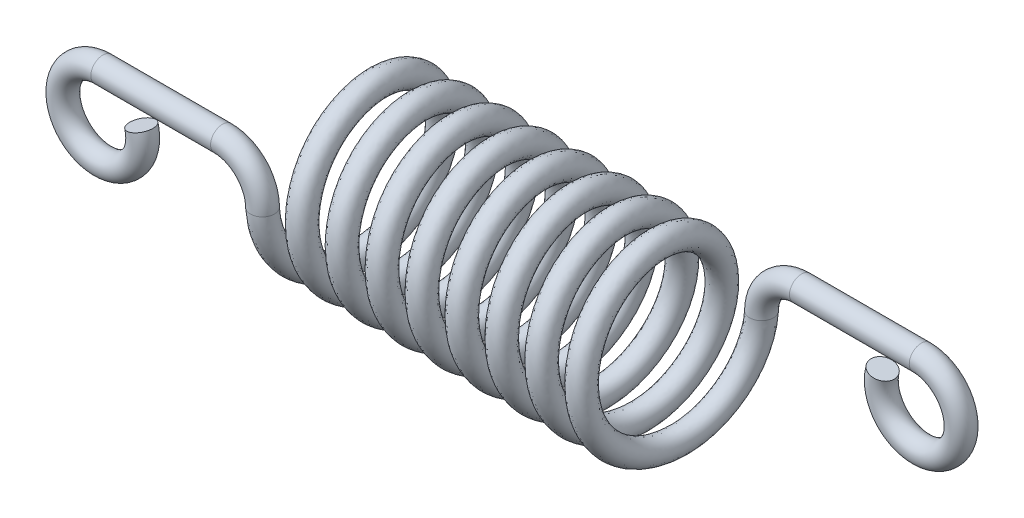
ISO-10303-21;
HEADER;
FILE_DESCRIPTION(('STEP AP214'),'2;1');
FILE_NAME('part.step','',(''),(''),'','','');
FILE_SCHEMA(('AUTOMOTIVE_DESIGN { 1 0 10303 214 1 1 1 1 }'));
ENDSEC;
DATA;
#1=APPLICATION_CONTEXT('core data for automotive mechanical design processes');
#2=APPLICATION_PROTOCOL_DEFINITION('international standard','automotive_design',2000,#1);
#3=PRODUCT_CONTEXT('',#1,'mechanical');
#4=PRODUCT('Part','Part','',(#3));
#5=PRODUCT_RELATED_PRODUCT_CATEGORY('part','',(#4));
#6=PRODUCT_DEFINITION_FORMATION('','',#4);
#7=PRODUCT_DEFINITION_CONTEXT('part definition',#1,'design');
#8=PRODUCT_DEFINITION('design','',#6,#7);
#9=PRODUCT_DEFINITION_SHAPE('','',#8);
#10=(LENGTH_UNIT() NAMED_UNIT(*) SI_UNIT(.MILLI.,.METRE.));
#11=(NAMED_UNIT(*) PLANE_ANGLE_UNIT() SI_UNIT($,.RADIAN.));
#12=(NAMED_UNIT(*) SI_UNIT($,.STERADIAN.) SOLID_ANGLE_UNIT());
#13=UNCERTAINTY_MEASURE_WITH_UNIT(LENGTH_MEASURE(1.E-05),#10,'distance_accuracy_value','');
#14=(GEOMETRIC_REPRESENTATION_CONTEXT(3) GLOBAL_UNCERTAINTY_ASSIGNED_CONTEXT((#13)) GLOBAL_UNIT_ASSIGNED_CONTEXT((#10,
#11,#12)) REPRESENTATION_CONTEXT('',''));
#15=CARTESIAN_POINT('',(0.,0.,0.));
#16=DIRECTION('',(0.,0.,1.));
#17=DIRECTION('',(1.,0.,0.));
#18=AXIS2_PLACEMENT_3D('',#15,#16,#17);
#19=CARTESIAN_POINT('',(5.,0.,0.));
#20=DIRECTION('',(0.,0.,1.));
#21=DIRECTION('',(1.,0.,0.));
#22=AXIS2_PLACEMENT_3D('',#19,#20,#21);
#23=TOROIDAL_SURFACE('',#22,5.,1.5);
#24=CARTESIAN_POINT('',(4.99999999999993,5.,0.));
#25=DIRECTION('',(1.,0.,0.));
#26=DIRECTION('',(0.,1.,0.));
#27=AXIS2_PLACEMENT_3D('',#24,#25,#26);
#28=CIRCLE('',#27,1.5);
#29=CARTESIAN_POINT('',(4.99999999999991,6.5,0.));
#30=VERTEX_POINT('',#29);
#31=EDGE_CURVE('E10',#30,#30,#28,.T.);
#32=CARTESIAN_POINT('',(0.,0.,0.));
#33=DIRECTION('',(0.,-1.,0.));
#34=DIRECTION('',(1.,0.,0.));
#35=AXIS2_PLACEMENT_3D('',#32,#33,#34);
#36=CIRCLE('',#35,1.5);
#37=CARTESIAN_POINT('',(-1.5,0.,0.));
#38=VERTEX_POINT('',#37);
#39=EDGE_CURVE('E48',#38,#38,#36,.T.);
#40=CARTESIAN_POINT('',(5.,0.,0.));
#41=DIRECTION('',(0.,0.,1.));
#42=DIRECTION('',(1.,0.,0.));
#43=AXIS2_PLACEMENT_3D('',#40,#41,#42);
#44=CIRCLE('',#43,6.5);
#45=EDGE_CURVE('',#30,#38,#44,.T.);
#46=ORIENTED_EDGE('',*,*,#31,.F.);
#47=ORIENTED_EDGE('',*,*,#39,.F.);
#48=ORIENTED_EDGE('',*,*,#45,.T.);
#49=ORIENTED_EDGE('',*,*,#45,.F.);
#50=EDGE_LOOP('',(#46,#48,#47,#49));
#51=FACE_BOUND('',#50,.T.);
#52=ADVANCED_FACE('F31',(#51),#23,.T.);
#53=CARTESIAN_POINT('',(19.9999999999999,5.,0.));
#54=DIRECTION('',(-1.,0.,0.));
#55=DIRECTION('',(0.,0.,1.));
#56=AXIS2_PLACEMENT_3D('',#53,#54,#55);
#57=CYLINDRICAL_SURFACE('',#56,1.5);
#58=CARTESIAN_POINT('',(19.9999999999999,5.,0.));
#59=DIRECTION('',(1.,0.,0.));
#60=DIRECTION('',(0.,1.,0.));
#61=AXIS2_PLACEMENT_3D('',#58,#59,#60);
#62=CIRCLE('',#61,1.5);
#63=CARTESIAN_POINT('',(19.9999999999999,6.5,0.));
#64=VERTEX_POINT('',#63);
#65=EDGE_CURVE('E38',#64,#64,#62,.T.);
#66=ORIENTED_EDGE('',*,*,#65,.F.);
#67=EDGE_LOOP('',(#66));
#68=FACE_BOUND('',#67,.T.);
#69=ORIENTED_EDGE('',*,*,#31,.T.);
#70=EDGE_LOOP('',(#69));
#71=FACE_BOUND('',#70,.T.);
#72=ADVANCED_FACE('F83',(#68,#71),#57,.T.);
#73=CARTESIAN_POINT('',(20.,0.,0.));
#74=DIRECTION('',(0.,0.,-1.));
#75=DIRECTION('',(-1.,0.,0.));
#76=AXIS2_PLACEMENT_3D('',#73,#74,#75);
#77=TOROIDAL_SURFACE('',#76,5.,1.5);
#78=CARTESIAN_POINT('',(15.1703708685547,1.29409522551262,0.));
#79=DIRECTION('',(0.258819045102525,0.965925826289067,0.));
#80=DIRECTION('',(-0.965925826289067,0.258819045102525,0.));
#81=AXIS2_PLACEMENT_3D('',#78,#79,#80);
#82=CIRCLE('',#81,1.5);
#83=CARTESIAN_POINT('',(13.7214821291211,1.68232379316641,0.));
#84=VERTEX_POINT('',#83);
#85=EDGE_CURVE('E43',#84,#84,#82,.T.);
#86=CARTESIAN_POINT('',(20.,0.,0.));
#87=DIRECTION('',(0.,0.,-1.));
#88=DIRECTION('',(-1.,0.,0.));
#89=AXIS2_PLACEMENT_3D('',#86,#87,#88);
#90=CIRCLE('',#89,6.5);
#91=EDGE_CURVE('',#64,#84,#90,.T.);
#92=ORIENTED_EDGE('',*,*,#65,.T.);
#93=ORIENTED_EDGE('',*,*,#85,.F.);
#94=ORIENTED_EDGE('',*,*,#91,.T.);
#95=ORIENTED_EDGE('',*,*,#91,.F.);
#96=EDGE_LOOP('',(#92,#94,#93,#95));
#97=FACE_BOUND('',#96,.T.);
#98=ADVANCED_FACE('F88',(#97),#77,.T.);
#99=CARTESIAN_POINT('',(15.1703708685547,1.29409522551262,0.));
#100=DIRECTION('',(0.258819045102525,0.965925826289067,0.));
#101=DIRECTION('',(-0.965925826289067,0.258819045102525,0.));
#102=AXIS2_PLACEMENT_3D('',#99,#100,#101);
#103=PLANE('',#102);
#104=ORIENTED_EDGE('',*,*,#85,.T.);
#105=EDGE_LOOP('',(#104));
#106=FACE_BOUND('',#105,.T.);
#107=ADVANCED_FACE('F94',(#106),#103,.T.);
#108=CARTESIAN_POINT('',(1.5,0.,0.));
#109=CARTESIAN_POINT('',(1.08333333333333,-5.77350269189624,0.));
#110=CARTESIAN_POINT('',(0.666666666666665,-8.66025403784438,4.99999999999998));
#111=CARTESIAN_POINT('',(0.25,-11.5470053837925,9.99999999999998));
#112=CARTESIAN_POINT('',(-0.166666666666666,-8.6602540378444,15.));
#113=CARTESIAN_POINT('',(-0.583333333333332,-5.77350269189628,20.));
#114=CARTESIAN_POINT('',(-0.999999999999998,0.,20.));
#115=CARTESIAN_POINT('',(-1.41666666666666,5.77350269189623,20.));
#116=CARTESIAN_POINT('',(-1.83333333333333,8.66025403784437,15.));
#117=CARTESIAN_POINT('',(-2.25,11.5470053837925,10.));
#118=CARTESIAN_POINT('',(-2.66666666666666,8.6602540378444,5.00000000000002));
#119=CARTESIAN_POINT('',(-3.08333333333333,5.77350269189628,0.));
#120=CARTESIAN_POINT('',(-3.49999999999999,0.,0.));
#121=CARTESIAN_POINT('',(-3.91666666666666,-5.77350269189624,0.));
#122=CARTESIAN_POINT('',(-4.33333333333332,-8.66025403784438,4.99999999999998));
#123=CARTESIAN_POINT('',(-4.74999999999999,-11.5470053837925,9.99999999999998));
#124=CARTESIAN_POINT('',(-5.16666666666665,-8.6602540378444,15.));
#125=CARTESIAN_POINT('',(-5.58333333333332,-5.77350269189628,20.));
#126=CARTESIAN_POINT('',(-5.99999999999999,0.,20.));
#127=CARTESIAN_POINT('',(-6.41666666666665,5.77350269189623,20.));
#128=CARTESIAN_POINT('',(-6.83333333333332,8.66025403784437,15.));
#129=CARTESIAN_POINT('',(-7.24999999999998,11.5470053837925,10.));
#130=CARTESIAN_POINT('',(-7.66666666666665,8.6602540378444,5.00000000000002));
#131=CARTESIAN_POINT('',(-8.08333333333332,5.77350269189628,0.));
#132=CARTESIAN_POINT('',(-8.49999999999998,0.,0.));
#133=CARTESIAN_POINT('',(-8.91666666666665,-5.77350269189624,0.));
#134=CARTESIAN_POINT('',(-9.33333333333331,-8.66025403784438,4.99999999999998));
#135=CARTESIAN_POINT('',(-9.74999999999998,-11.5470053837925,9.99999999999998));
#136=CARTESIAN_POINT('',(-10.1666666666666,-8.6602540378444,15.));
#137=CARTESIAN_POINT('',(-10.5833333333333,-5.77350269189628,20.));
#138=CARTESIAN_POINT('',(-11.,0.,20.));
#139=CARTESIAN_POINT('',(-11.4166666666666,5.77350269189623,20.));
#140=CARTESIAN_POINT('',(-11.8333333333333,8.66025403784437,15.));
#141=CARTESIAN_POINT('',(-12.25,11.5470053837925,10.));
#142=CARTESIAN_POINT('',(-12.6666666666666,8.6602540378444,5.00000000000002));
#143=CARTESIAN_POINT('',(-13.0833333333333,5.77350269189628,0.));
#144=CARTESIAN_POINT('',(-13.5,0.,0.));
#145=CARTESIAN_POINT('',(-13.9166666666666,-5.77350269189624,0.));
#146=CARTESIAN_POINT('',(-14.3333333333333,-8.66025403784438,4.99999999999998));
#147=CARTESIAN_POINT('',(-14.75,-11.5470053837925,9.99999999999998));
#148=CARTESIAN_POINT('',(-15.1666666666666,-8.6602540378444,15.));
#149=CARTESIAN_POINT('',(-15.5833333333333,-5.77350269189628,20.));
#150=CARTESIAN_POINT('',(-16.,0.,20.));
#151=CARTESIAN_POINT('',(-16.4166666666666,5.77350269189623,20.));
#152=CARTESIAN_POINT('',(-16.8333333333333,8.66025403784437,15.));
#153=CARTESIAN_POINT('',(-17.25,11.5470053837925,10.));
#154=CARTESIAN_POINT('',(-17.6666666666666,8.6602540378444,5.00000000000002));
#155=CARTESIAN_POINT('',(-18.0833333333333,5.77350269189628,0.));
#156=CARTESIAN_POINT('',(-18.5,0.,0.));
#157=CARTESIAN_POINT('',(-18.9166666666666,-5.77350269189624,0.));
#158=CARTESIAN_POINT('',(-19.3333333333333,-8.66025403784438,4.99999999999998));
#159=CARTESIAN_POINT('',(-19.75,-11.5470053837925,9.99999999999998));
#160=CARTESIAN_POINT('',(-20.1666666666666,-8.6602540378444,15.));
#161=CARTESIAN_POINT('',(-20.5833333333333,-5.77350269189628,20.));
#162=CARTESIAN_POINT('',(-21.,0.,20.));
#163=CARTESIAN_POINT('',(-21.4166666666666,5.77350269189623,20.));
#164=CARTESIAN_POINT('',(-21.8333333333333,8.66025403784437,15.));
#165=CARTESIAN_POINT('',(-22.2499999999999,11.5470053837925,10.));
#166=CARTESIAN_POINT('',(-22.6666666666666,8.6602540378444,5.00000000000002));
#167=CARTESIAN_POINT('',(-23.0833333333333,5.77350269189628,0.));
#168=CARTESIAN_POINT('',(-23.4999999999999,0.,0.));
#169=CARTESIAN_POINT('',(-23.9166666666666,-5.77350269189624,0.));
#170=CARTESIAN_POINT('',(-24.3333333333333,-8.66025403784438,4.99999999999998));
#171=CARTESIAN_POINT('',(-24.7499999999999,-11.5470053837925,9.99999999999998));
#172=CARTESIAN_POINT('',(-25.1666666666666,-8.6602540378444,15.));
#173=CARTESIAN_POINT('',(-25.5833333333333,-5.77350269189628,20.));
#174=CARTESIAN_POINT('',(-25.9999999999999,0.,20.));
#175=CARTESIAN_POINT('',(-26.4166666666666,5.77350269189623,20.));
#176=CARTESIAN_POINT('',(-26.8333333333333,8.66025403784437,15.));
#177=CARTESIAN_POINT('',(-27.2499999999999,11.5470053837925,10.));
#178=CARTESIAN_POINT('',(-27.6666666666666,8.6602540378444,5.00000000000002));
#179=CARTESIAN_POINT('',(-28.0833333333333,5.77350269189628,0.));
#180=CARTESIAN_POINT('',(-28.4999999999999,0.,0.));
#181=CARTESIAN_POINT('',(-28.9166666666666,-5.77350269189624,0.));
#182=CARTESIAN_POINT('',(-29.3333333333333,-8.66025403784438,4.99999999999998));
#183=CARTESIAN_POINT('',(-29.7499999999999,-11.5470053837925,9.99999999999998));
#184=CARTESIAN_POINT('',(-30.1666666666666,-8.6602540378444,15.));
#185=CARTESIAN_POINT('',(-30.5833333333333,-5.77350269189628,20.));
#186=CARTESIAN_POINT('',(-30.9999999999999,0.,20.));
#187=CARTESIAN_POINT('',(-31.4166666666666,5.77350269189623,20.));
#188=CARTESIAN_POINT('',(-31.8333333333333,8.66025403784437,15.));
#189=CARTESIAN_POINT('',(-32.2499999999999,11.5470053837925,10.));
#190=CARTESIAN_POINT('',(-32.6666666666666,8.6602540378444,5.00000000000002));
#191=CARTESIAN_POINT('',(-33.0833333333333,5.77350269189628,0.));
#192=CARTESIAN_POINT('',(-33.4999999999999,0.,0.));
#193=CARTESIAN_POINT('',(-33.9166666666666,-5.77350269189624,0.));
#194=CARTESIAN_POINT('',(-34.3333333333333,-8.66025403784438,4.99999999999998));
#195=CARTESIAN_POINT('',(-34.7499999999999,-11.5470053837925,9.99999999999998));
#196=CARTESIAN_POINT('',(-35.1666666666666,-8.6602540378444,15.));
#197=CARTESIAN_POINT('',(-35.5833333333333,-5.77350269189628,20.));
#198=CARTESIAN_POINT('',(-35.9999999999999,0.,20.));
#199=CARTESIAN_POINT('',(-36.4166666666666,5.77350269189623,20.));
#200=CARTESIAN_POINT('',(-36.8333333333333,8.66025403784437,15.));
#201=CARTESIAN_POINT('',(-37.2499999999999,11.5470053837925,10.));
#202=CARTESIAN_POINT('',(-37.6666666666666,8.6602540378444,5.00000000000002));
#203=CARTESIAN_POINT('',(-38.0833333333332,5.77350269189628,0.));
#204=CARTESIAN_POINT('',(-38.4999999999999,0.,0.));
#205=CARTESIAN_POINT('',(-38.9166666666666,-5.77350269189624,0.));
#206=CARTESIAN_POINT('',(-39.3333333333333,-8.66025403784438,4.99999999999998));
#207=CARTESIAN_POINT('',(-39.7499999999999,-11.5470053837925,9.99999999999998));
#208=CARTESIAN_POINT('',(-40.1666666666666,-8.6602540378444,15.));
#209=CARTESIAN_POINT('',(-40.5833333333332,-5.77350269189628,20.));
#210=CARTESIAN_POINT('',(-40.9999999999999,0.,20.));
#211=CARTESIAN_POINT('',(-41.4166666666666,5.77350269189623,20.));
#212=CARTESIAN_POINT('',(-41.8333333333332,8.66025403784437,15.));
#213=CARTESIAN_POINT('',(-42.2499999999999,11.5470053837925,10.));
#214=CARTESIAN_POINT('',(-42.6666666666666,8.6602540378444,5.00000000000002));
#215=CARTESIAN_POINT('',(-43.0833333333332,5.77350269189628,0.));
#216=CARTESIAN_POINT('',(-43.4999999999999,0.,0.));
#217=CARTESIAN_POINT('',(1.5,0.,3.));
#218=CARTESIAN_POINT('',(1.08333333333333,-4.04145188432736,2.99999999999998));
#219=CARTESIAN_POINT('',(0.666666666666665,-6.06217782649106,6.49999999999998));
#220=CARTESIAN_POINT('',(0.25,-8.08290376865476,9.99999999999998));
#221=CARTESIAN_POINT('',(-0.166666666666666,-6.06217782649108,13.5));
#222=CARTESIAN_POINT('',(-0.583333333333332,-4.04145188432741,17.));
#223=CARTESIAN_POINT('',(-0.999999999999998,0.,17.));
#224=CARTESIAN_POINT('',(-1.41666666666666,4.04145188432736,17.));
#225=CARTESIAN_POINT('',(-1.83333333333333,6.06217782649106,13.5));
#226=CARTESIAN_POINT('',(-2.25,8.08290376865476,10.));
#227=CARTESIAN_POINT('',(-2.66666666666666,6.06217782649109,6.50000000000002));
#228=CARTESIAN_POINT('',(-3.08333333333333,4.04145188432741,3.00000000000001));
#229=CARTESIAN_POINT('',(-3.49999999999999,0.,3.));
#230=CARTESIAN_POINT('',(-3.91666666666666,-4.04145188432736,2.99999999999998));
#231=CARTESIAN_POINT('',(-4.33333333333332,-6.06217782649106,6.49999999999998));
#232=CARTESIAN_POINT('',(-4.74999999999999,-8.08290376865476,9.99999999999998));
#233=CARTESIAN_POINT('',(-5.16666666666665,-6.06217782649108,13.5));
#234=CARTESIAN_POINT('',(-5.58333333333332,-4.04145188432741,17.));
#235=CARTESIAN_POINT('',(-5.99999999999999,0.,17.));
#236=CARTESIAN_POINT('',(-6.41666666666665,4.04145188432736,17.));
#237=CARTESIAN_POINT('',(-6.83333333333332,6.06217782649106,13.5));
#238=CARTESIAN_POINT('',(-7.24999999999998,8.08290376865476,10.));
#239=CARTESIAN_POINT('',(-7.66666666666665,6.06217782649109,6.50000000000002));
#240=CARTESIAN_POINT('',(-8.08333333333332,4.04145188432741,3.00000000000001));
#241=CARTESIAN_POINT('',(-8.49999999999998,0.,3.));
#242=CARTESIAN_POINT('',(-8.91666666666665,-4.04145188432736,2.99999999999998));
#243=CARTESIAN_POINT('',(-9.33333333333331,-6.06217782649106,6.49999999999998));
#244=CARTESIAN_POINT('',(-9.74999999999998,-8.08290376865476,9.99999999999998));
#245=CARTESIAN_POINT('',(-10.1666666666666,-6.06217782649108,13.5));
#246=CARTESIAN_POINT('',(-10.5833333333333,-4.04145188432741,17.));
#247=CARTESIAN_POINT('',(-11.,0.,17.));
#248=CARTESIAN_POINT('',(-11.4166666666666,4.04145188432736,17.));
#249=CARTESIAN_POINT('',(-11.8333333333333,6.06217782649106,13.5));
#250=CARTESIAN_POINT('',(-12.25,8.08290376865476,10.));
#251=CARTESIAN_POINT('',(-12.6666666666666,6.06217782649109,6.50000000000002));
#252=CARTESIAN_POINT('',(-13.0833333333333,4.04145188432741,3.00000000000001));
#253=CARTESIAN_POINT('',(-13.5,0.,3.));
#254=CARTESIAN_POINT('',(-13.9166666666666,-4.04145188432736,2.99999999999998));
#255=CARTESIAN_POINT('',(-14.3333333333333,-6.06217782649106,6.49999999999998));
#256=CARTESIAN_POINT('',(-14.75,-8.08290376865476,9.99999999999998));
#257=CARTESIAN_POINT('',(-15.1666666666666,-6.06217782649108,13.5));
#258=CARTESIAN_POINT('',(-15.5833333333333,-4.04145188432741,17.));
#259=CARTESIAN_POINT('',(-16.,0.,17.));
#260=CARTESIAN_POINT('',(-16.4166666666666,4.04145188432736,17.));
#261=CARTESIAN_POINT('',(-16.8333333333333,6.06217782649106,13.5));
#262=CARTESIAN_POINT('',(-17.25,8.08290376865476,10.));
#263=CARTESIAN_POINT('',(-17.6666666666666,6.06217782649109,6.50000000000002));
#264=CARTESIAN_POINT('',(-18.0833333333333,4.04145188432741,3.00000000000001));
#265=CARTESIAN_POINT('',(-18.5,0.,3.));
#266=CARTESIAN_POINT('',(-18.9166666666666,-4.04145188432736,2.99999999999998));
#267=CARTESIAN_POINT('',(-19.3333333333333,-6.06217782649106,6.49999999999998));
#268=CARTESIAN_POINT('',(-19.75,-8.08290376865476,9.99999999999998));
#269=CARTESIAN_POINT('',(-20.1666666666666,-6.06217782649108,13.5));
#270=CARTESIAN_POINT('',(-20.5833333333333,-4.04145188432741,17.));
#271=CARTESIAN_POINT('',(-21.,0.,17.));
#272=CARTESIAN_POINT('',(-21.4166666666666,4.04145188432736,17.));
#273=CARTESIAN_POINT('',(-21.8333333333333,6.06217782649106,13.5));
#274=CARTESIAN_POINT('',(-22.2499999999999,8.08290376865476,10.));
#275=CARTESIAN_POINT('',(-22.6666666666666,6.06217782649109,6.50000000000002));
#276=CARTESIAN_POINT('',(-23.0833333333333,4.04145188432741,3.00000000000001));
#277=CARTESIAN_POINT('',(-23.4999999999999,0.,3.));
#278=CARTESIAN_POINT('',(-23.9166666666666,-4.04145188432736,2.99999999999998));
#279=CARTESIAN_POINT('',(-24.3333333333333,-6.06217782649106,6.49999999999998));
#280=CARTESIAN_POINT('',(-24.7499999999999,-8.08290376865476,9.99999999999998));
#281=CARTESIAN_POINT('',(-25.1666666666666,-6.06217782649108,13.5));
#282=CARTESIAN_POINT('',(-25.5833333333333,-4.04145188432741,17.));
#283=CARTESIAN_POINT('',(-25.9999999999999,0.,17.));
#284=CARTESIAN_POINT('',(-26.4166666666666,4.04145188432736,17.));
#285=CARTESIAN_POINT('',(-26.8333333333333,6.06217782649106,13.5));
#286=CARTESIAN_POINT('',(-27.2499999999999,8.08290376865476,10.));
#287=CARTESIAN_POINT('',(-27.6666666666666,6.06217782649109,6.50000000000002));
#288=CARTESIAN_POINT('',(-28.0833333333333,4.04145188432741,3.00000000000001));
#289=CARTESIAN_POINT('',(-28.4999999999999,0.,3.));
#290=CARTESIAN_POINT('',(-28.9166666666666,-4.04145188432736,2.99999999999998));
#291=CARTESIAN_POINT('',(-29.3333333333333,-6.06217782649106,6.49999999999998));
#292=CARTESIAN_POINT('',(-29.7499999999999,-8.08290376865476,9.99999999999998));
#293=CARTESIAN_POINT('',(-30.1666666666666,-6.06217782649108,13.5));
#294=CARTESIAN_POINT('',(-30.5833333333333,-4.04145188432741,17.));
#295=CARTESIAN_POINT('',(-30.9999999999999,0.,17.));
#296=CARTESIAN_POINT('',(-31.4166666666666,4.04145188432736,17.));
#297=CARTESIAN_POINT('',(-31.8333333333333,6.06217782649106,13.5));
#298=CARTESIAN_POINT('',(-32.2499999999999,8.08290376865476,10.));
#299=CARTESIAN_POINT('',(-32.6666666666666,6.06217782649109,6.50000000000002));
#300=CARTESIAN_POINT('',(-33.0833333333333,4.04145188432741,3.00000000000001));
#301=CARTESIAN_POINT('',(-33.4999999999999,0.,3.));
#302=CARTESIAN_POINT('',(-33.9166666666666,-4.04145188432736,2.99999999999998));
#303=CARTESIAN_POINT('',(-34.3333333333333,-6.06217782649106,6.49999999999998));
#304=CARTESIAN_POINT('',(-34.7499999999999,-8.08290376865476,9.99999999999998));
#305=CARTESIAN_POINT('',(-35.1666666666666,-6.06217782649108,13.5));
#306=CARTESIAN_POINT('',(-35.5833333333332,-4.04145188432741,17.));
#307=CARTESIAN_POINT('',(-35.9999999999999,0.,17.));
#308=CARTESIAN_POINT('',(-36.4166666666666,4.04145188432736,17.));
#309=CARTESIAN_POINT('',(-36.8333333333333,6.06217782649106,13.5));
#310=CARTESIAN_POINT('',(-37.2499999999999,8.08290376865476,10.));
#311=CARTESIAN_POINT('',(-37.6666666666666,6.06217782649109,6.50000000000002));
#312=CARTESIAN_POINT('',(-38.0833333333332,4.04145188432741,3.00000000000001));
#313=CARTESIAN_POINT('',(-38.4999999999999,0.,3.));
#314=CARTESIAN_POINT('',(-38.9166666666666,-4.04145188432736,2.99999999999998));
#315=CARTESIAN_POINT('',(-39.3333333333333,-6.06217782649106,6.49999999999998));
#316=CARTESIAN_POINT('',(-39.7499999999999,-8.08290376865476,9.99999999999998));
#317=CARTESIAN_POINT('',(-40.1666666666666,-6.06217782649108,13.5));
#318=CARTESIAN_POINT('',(-40.5833333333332,-4.04145188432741,17.));
#319=CARTESIAN_POINT('',(-40.9999999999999,0.,17.));
#320=CARTESIAN_POINT('',(-41.4166666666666,4.04145188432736,17.));
#321=CARTESIAN_POINT('',(-41.8333333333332,6.06217782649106,13.5));
#322=CARTESIAN_POINT('',(-42.2499999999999,8.08290376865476,10.));
#323=CARTESIAN_POINT('',(-42.6666666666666,6.06217782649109,6.50000000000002));
#324=CARTESIAN_POINT('',(-43.0833333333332,4.04145188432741,3.00000000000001));
#325=CARTESIAN_POINT('',(-43.4999999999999,0.,3.));
#326=CARTESIAN_POINT('',(-1.5,0.,3.));
#327=CARTESIAN_POINT('',(-1.91666666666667,-4.0414518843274,3.00000000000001));
#328=CARTESIAN_POINT('',(-2.33333333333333,-6.06217782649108,6.50000000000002));
#329=CARTESIAN_POINT('',(-2.75,-8.08290376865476,10.));
#330=CARTESIAN_POINT('',(-3.16666666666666,-6.06217782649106,13.5));
#331=CARTESIAN_POINT('',(-3.58333333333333,-4.04145188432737,17.));
#332=CARTESIAN_POINT('',(-3.99999999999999,0.,17.));
#333=CARTESIAN_POINT('',(-4.41666666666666,4.0414518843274,17.));
#334=CARTESIAN_POINT('',(-4.83333333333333,6.06217782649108,13.5));
#335=CARTESIAN_POINT('',(-5.24999999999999,8.08290376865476,9.99999999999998));
#336=CARTESIAN_POINT('',(-5.66666666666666,6.06217782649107,6.49999999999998));
#337=CARTESIAN_POINT('',(-6.08333333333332,4.04145188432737,2.99999999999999));
#338=CARTESIAN_POINT('',(-6.49999999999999,0.,3.));
#339=CARTESIAN_POINT('',(-6.91666666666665,-4.0414518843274,3.00000000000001));
#340=CARTESIAN_POINT('',(-7.33333333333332,-6.06217782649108,6.50000000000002));
#341=CARTESIAN_POINT('',(-7.74999999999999,-8.08290376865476,10.));
#342=CARTESIAN_POINT('',(-8.16666666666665,-6.06217782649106,13.5));
#343=CARTESIAN_POINT('',(-8.58333333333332,-4.04145188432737,17.));
#344=CARTESIAN_POINT('',(-8.99999999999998,0.,17.));
#345=CARTESIAN_POINT('',(-9.41666666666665,4.0414518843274,17.));
#346=CARTESIAN_POINT('',(-9.83333333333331,6.06217782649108,13.5));
#347=CARTESIAN_POINT('',(-10.25,8.08290376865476,9.99999999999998));
#348=CARTESIAN_POINT('',(-10.6666666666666,6.06217782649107,6.49999999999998));
#349=CARTESIAN_POINT('',(-11.0833333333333,4.04145188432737,2.99999999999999));
#350=CARTESIAN_POINT('',(-11.5,0.,3.));
#351=CARTESIAN_POINT('',(-11.9166666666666,-4.0414518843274,3.00000000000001));
#352=CARTESIAN_POINT('',(-12.3333333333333,-6.06217782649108,6.50000000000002));
#353=CARTESIAN_POINT('',(-12.75,-8.08290376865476,10.));
#354=CARTESIAN_POINT('',(-13.1666666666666,-6.06217782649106,13.5));
#355=CARTESIAN_POINT('',(-13.5833333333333,-4.04145188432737,17.));
#356=CARTESIAN_POINT('',(-14.,0.,17.));
#357=CARTESIAN_POINT('',(-14.4166666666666,4.0414518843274,17.));
#358=CARTESIAN_POINT('',(-14.8333333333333,6.06217782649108,13.5));
#359=CARTESIAN_POINT('',(-15.25,8.08290376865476,9.99999999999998));
#360=CARTESIAN_POINT('',(-15.6666666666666,6.06217782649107,6.49999999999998));
#361=CARTESIAN_POINT('',(-16.0833333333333,4.04145188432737,2.99999999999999));
#362=CARTESIAN_POINT('',(-16.5,0.,3.));
#363=CARTESIAN_POINT('',(-16.9166666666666,-4.0414518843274,3.00000000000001));
#364=CARTESIAN_POINT('',(-17.3333333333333,-6.06217782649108,6.50000000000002));
#365=CARTESIAN_POINT('',(-17.75,-8.08290376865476,10.));
#366=CARTESIAN_POINT('',(-18.1666666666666,-6.06217782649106,13.5));
#367=CARTESIAN_POINT('',(-18.5833333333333,-4.04145188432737,17.));
#368=CARTESIAN_POINT('',(-19.,0.,17.));
#369=CARTESIAN_POINT('',(-19.4166666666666,4.0414518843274,17.));
#370=CARTESIAN_POINT('',(-19.8333333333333,6.06217782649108,13.5));
#371=CARTESIAN_POINT('',(-20.25,8.08290376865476,9.99999999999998));
#372=CARTESIAN_POINT('',(-20.6666666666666,6.06217782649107,6.49999999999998));
#373=CARTESIAN_POINT('',(-21.0833333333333,4.04145188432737,2.99999999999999));
#374=CARTESIAN_POINT('',(-21.5,0.,3.));
#375=CARTESIAN_POINT('',(-21.9166666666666,-4.0414518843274,3.00000000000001));
#376=CARTESIAN_POINT('',(-22.3333333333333,-6.06217782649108,6.50000000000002));
#377=CARTESIAN_POINT('',(-22.75,-8.08290376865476,10.));
#378=CARTESIAN_POINT('',(-23.1666666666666,-6.06217782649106,13.5));
#379=CARTESIAN_POINT('',(-23.5833333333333,-4.04145188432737,17.));
#380=CARTESIAN_POINT('',(-24.,0.,17.));
#381=CARTESIAN_POINT('',(-24.4166666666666,4.0414518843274,17.));
#382=CARTESIAN_POINT('',(-24.8333333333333,6.06217782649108,13.5));
#383=CARTESIAN_POINT('',(-25.25,8.08290376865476,9.99999999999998));
#384=CARTESIAN_POINT('',(-25.6666666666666,6.06217782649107,6.49999999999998));
#385=CARTESIAN_POINT('',(-26.0833333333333,4.04145188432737,2.99999999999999));
#386=CARTESIAN_POINT('',(-26.4999999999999,0.,3.));
#387=CARTESIAN_POINT('',(-26.9166666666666,-4.0414518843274,3.00000000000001));
#388=CARTESIAN_POINT('',(-27.3333333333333,-6.06217782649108,6.50000000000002));
#389=CARTESIAN_POINT('',(-27.7499999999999,-8.08290376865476,10.));
#390=CARTESIAN_POINT('',(-28.1666666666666,-6.06217782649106,13.5));
#391=CARTESIAN_POINT('',(-28.5833333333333,-4.04145188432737,17.));
#392=CARTESIAN_POINT('',(-28.9999999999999,0.,17.));
#393=CARTESIAN_POINT('',(-29.4166666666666,4.0414518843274,17.));
#394=CARTESIAN_POINT('',(-29.8333333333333,6.06217782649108,13.5));
#395=CARTESIAN_POINT('',(-30.2499999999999,8.08290376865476,9.99999999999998));
#396=CARTESIAN_POINT('',(-30.6666666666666,6.06217782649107,6.49999999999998));
#397=CARTESIAN_POINT('',(-31.0833333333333,4.04145188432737,2.99999999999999));
#398=CARTESIAN_POINT('',(-31.4999999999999,0.,3.));
#399=CARTESIAN_POINT('',(-31.9166666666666,-4.0414518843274,3.00000000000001));
#400=CARTESIAN_POINT('',(-32.3333333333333,-6.06217782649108,6.50000000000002));
#401=CARTESIAN_POINT('',(-32.7499999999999,-8.08290376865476,10.));
#402=CARTESIAN_POINT('',(-33.1666666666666,-6.06217782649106,13.5));
#403=CARTESIAN_POINT('',(-33.5833333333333,-4.04145188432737,17.));
#404=CARTESIAN_POINT('',(-33.9999999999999,0.,17.));
#405=CARTESIAN_POINT('',(-34.4166666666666,4.0414518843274,17.));
#406=CARTESIAN_POINT('',(-34.8333333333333,6.06217782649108,13.5));
#407=CARTESIAN_POINT('',(-35.2499999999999,8.08290376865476,9.99999999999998));
#408=CARTESIAN_POINT('',(-35.6666666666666,6.06217782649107,6.49999999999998));
#409=CARTESIAN_POINT('',(-36.0833333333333,4.04145188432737,2.99999999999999));
#410=CARTESIAN_POINT('',(-36.4999999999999,0.,3.));
#411=CARTESIAN_POINT('',(-36.9166666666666,-4.0414518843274,3.00000000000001));
#412=CARTESIAN_POINT('',(-37.3333333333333,-6.06217782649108,6.50000000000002));
#413=CARTESIAN_POINT('',(-37.7499999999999,-8.08290376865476,10.));
#414=CARTESIAN_POINT('',(-38.1666666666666,-6.06217782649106,13.5));
#415=CARTESIAN_POINT('',(-38.5833333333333,-4.04145188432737,17.));
#416=CARTESIAN_POINT('',(-38.9999999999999,0.,17.));
#417=CARTESIAN_POINT('',(-39.4166666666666,4.0414518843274,17.));
#418=CARTESIAN_POINT('',(-39.8333333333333,6.06217782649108,13.5));
#419=CARTESIAN_POINT('',(-40.2499999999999,8.08290376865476,9.99999999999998));
#420=CARTESIAN_POINT('',(-40.6666666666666,6.06217782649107,6.49999999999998));
#421=CARTESIAN_POINT('',(-41.0833333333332,4.04145188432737,2.99999999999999));
#422=CARTESIAN_POINT('',(-41.4999999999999,0.,3.));
#423=CARTESIAN_POINT('',(-41.9166666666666,-4.0414518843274,3.00000000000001));
#424=CARTESIAN_POINT('',(-42.3333333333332,-6.06217782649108,6.50000000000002));
#425=CARTESIAN_POINT('',(-42.7499999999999,-8.08290376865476,10.));
#426=CARTESIAN_POINT('',(-43.1666666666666,-6.06217782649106,13.5));
#427=CARTESIAN_POINT('',(-43.5833333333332,-4.04145188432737,17.));
#428=CARTESIAN_POINT('',(-43.9999999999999,0.,17.));
#429=CARTESIAN_POINT('',(-44.4166666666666,4.0414518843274,17.));
#430=CARTESIAN_POINT('',(-44.8333333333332,6.06217782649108,13.5));
#431=CARTESIAN_POINT('',(-45.2499999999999,8.08290376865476,9.99999999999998));
#432=CARTESIAN_POINT('',(-45.6666666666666,6.06217782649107,6.49999999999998));
#433=CARTESIAN_POINT('',(-46.0833333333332,4.04145188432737,2.99999999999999));
#434=CARTESIAN_POINT('',(-46.4999999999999,0.,3.));
#435=CARTESIAN_POINT('',(-1.5,0.,0.));
#436=CARTESIAN_POINT('',(-1.91666666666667,-5.77350269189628,0.));
#437=CARTESIAN_POINT('',(-2.33333333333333,-8.6602540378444,5.00000000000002));
#438=CARTESIAN_POINT('',(-2.75,-11.5470053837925,10.));
#439=CARTESIAN_POINT('',(-3.16666666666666,-8.66025403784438,15.));
#440=CARTESIAN_POINT('',(-3.58333333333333,-5.77350269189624,20.));
#441=CARTESIAN_POINT('',(-3.99999999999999,0.,20.));
#442=CARTESIAN_POINT('',(-4.41666666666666,5.77350269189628,20.));
#443=CARTESIAN_POINT('',(-4.83333333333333,8.66025403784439,15.));
#444=CARTESIAN_POINT('',(-5.24999999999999,11.5470053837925,9.99999999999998));
#445=CARTESIAN_POINT('',(-5.66666666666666,8.66025403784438,4.99999999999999));
#446=CARTESIAN_POINT('',(-6.08333333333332,5.77350269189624,0.));
#447=CARTESIAN_POINT('',(-6.49999999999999,0.,0.));
#448=CARTESIAN_POINT('',(-6.91666666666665,-5.77350269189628,0.));
#449=CARTESIAN_POINT('',(-7.33333333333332,-8.6602540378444,5.00000000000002));
#450=CARTESIAN_POINT('',(-7.74999999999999,-11.5470053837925,10.));
#451=CARTESIAN_POINT('',(-8.16666666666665,-8.66025403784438,15.));
#452=CARTESIAN_POINT('',(-8.58333333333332,-5.77350269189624,20.));
#453=CARTESIAN_POINT('',(-8.99999999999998,0.,20.));
#454=CARTESIAN_POINT('',(-9.41666666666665,5.77350269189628,20.));
#455=CARTESIAN_POINT('',(-9.83333333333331,8.66025403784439,15.));
#456=CARTESIAN_POINT('',(-10.25,11.5470053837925,9.99999999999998));
#457=CARTESIAN_POINT('',(-10.6666666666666,8.66025403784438,4.99999999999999));
#458=CARTESIAN_POINT('',(-11.0833333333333,5.77350269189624,0.));
#459=CARTESIAN_POINT('',(-11.5,0.,0.));
#460=CARTESIAN_POINT('',(-11.9166666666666,-5.77350269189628,0.));
#461=CARTESIAN_POINT('',(-12.3333333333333,-8.6602540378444,5.00000000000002));
#462=CARTESIAN_POINT('',(-12.75,-11.5470053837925,10.));
#463=CARTESIAN_POINT('',(-13.1666666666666,-8.66025403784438,15.));
#464=CARTESIAN_POINT('',(-13.5833333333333,-5.77350269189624,20.));
#465=CARTESIAN_POINT('',(-14.,0.,20.));
#466=CARTESIAN_POINT('',(-14.4166666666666,5.77350269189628,20.));
#467=CARTESIAN_POINT('',(-14.8333333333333,8.66025403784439,15.));
#468=CARTESIAN_POINT('',(-15.25,11.5470053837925,9.99999999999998));
#469=CARTESIAN_POINT('',(-15.6666666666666,8.66025403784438,4.99999999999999));
#470=CARTESIAN_POINT('',(-16.0833333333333,5.77350269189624,0.));
#471=CARTESIAN_POINT('',(-16.5,0.,0.));
#472=CARTESIAN_POINT('',(-16.9166666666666,-5.77350269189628,0.));
#473=CARTESIAN_POINT('',(-17.3333333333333,-8.6602540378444,5.00000000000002));
#474=CARTESIAN_POINT('',(-17.75,-11.5470053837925,10.));
#475=CARTESIAN_POINT('',(-18.1666666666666,-8.66025403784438,15.));
#476=CARTESIAN_POINT('',(-18.5833333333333,-5.77350269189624,20.));
#477=CARTESIAN_POINT('',(-19.,0.,20.));
#478=CARTESIAN_POINT('',(-19.4166666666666,5.77350269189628,20.));
#479=CARTESIAN_POINT('',(-19.8333333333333,8.66025403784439,15.));
#480=CARTESIAN_POINT('',(-20.25,11.5470053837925,9.99999999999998));
#481=CARTESIAN_POINT('',(-20.6666666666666,8.66025403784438,4.99999999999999));
#482=CARTESIAN_POINT('',(-21.0833333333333,5.77350269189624,0.));
#483=CARTESIAN_POINT('',(-21.5,0.,0.));
#484=CARTESIAN_POINT('',(-21.9166666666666,-5.77350269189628,0.));
#485=CARTESIAN_POINT('',(-22.3333333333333,-8.6602540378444,5.00000000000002));
#486=CARTESIAN_POINT('',(-22.75,-11.5470053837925,10.));
#487=CARTESIAN_POINT('',(-23.1666666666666,-8.66025403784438,15.));
#488=CARTESIAN_POINT('',(-23.5833333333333,-5.77350269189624,20.));
#489=CARTESIAN_POINT('',(-23.9999999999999,0.,20.));
#490=CARTESIAN_POINT('',(-24.4166666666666,5.77350269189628,20.));
#491=CARTESIAN_POINT('',(-24.8333333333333,8.66025403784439,15.));
#492=CARTESIAN_POINT('',(-25.2499999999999,11.5470053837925,9.99999999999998));
#493=CARTESIAN_POINT('',(-25.6666666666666,8.66025403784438,4.99999999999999));
#494=CARTESIAN_POINT('',(-26.0833333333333,5.77350269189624,0.));
#495=CARTESIAN_POINT('',(-26.4999999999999,0.,0.));
#496=CARTESIAN_POINT('',(-26.9166666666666,-5.77350269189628,0.));
#497=CARTESIAN_POINT('',(-27.3333333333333,-8.6602540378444,5.00000000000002));
#498=CARTESIAN_POINT('',(-27.7499999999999,-11.5470053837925,10.));
#499=CARTESIAN_POINT('',(-28.1666666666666,-8.66025403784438,15.));
#500=CARTESIAN_POINT('',(-28.5833333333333,-5.77350269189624,20.));
#501=CARTESIAN_POINT('',(-28.9999999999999,0.,20.));
#502=CARTESIAN_POINT('',(-29.4166666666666,5.77350269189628,20.));
#503=CARTESIAN_POINT('',(-29.8333333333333,8.66025403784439,15.));
#504=CARTESIAN_POINT('',(-30.2499999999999,11.5470053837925,9.99999999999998));
#505=CARTESIAN_POINT('',(-30.6666666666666,8.66025403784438,4.99999999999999));
#506=CARTESIAN_POINT('',(-31.0833333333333,5.77350269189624,0.));
#507=CARTESIAN_POINT('',(-31.4999999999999,0.,0.));
#508=CARTESIAN_POINT('',(-31.9166666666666,-5.77350269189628,0.));
#509=CARTESIAN_POINT('',(-32.3333333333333,-8.6602540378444,5.00000000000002));
#510=CARTESIAN_POINT('',(-32.7499999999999,-11.5470053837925,10.));
#511=CARTESIAN_POINT('',(-33.1666666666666,-8.66025403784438,15.));
#512=CARTESIAN_POINT('',(-33.5833333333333,-5.77350269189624,20.));
#513=CARTESIAN_POINT('',(-33.9999999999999,0.,20.));
#514=CARTESIAN_POINT('',(-34.4166666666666,5.77350269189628,20.));
#515=CARTESIAN_POINT('',(-34.8333333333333,8.66025403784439,15.));
#516=CARTESIAN_POINT('',(-35.2499999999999,11.5470053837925,9.99999999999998));
#517=CARTESIAN_POINT('',(-35.6666666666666,8.66025403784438,4.99999999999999));
#518=CARTESIAN_POINT('',(-36.0833333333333,5.77350269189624,0.));
#519=CARTESIAN_POINT('',(-36.4999999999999,0.,0.));
#520=CARTESIAN_POINT('',(-36.9166666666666,-5.77350269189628,0.));
#521=CARTESIAN_POINT('',(-37.3333333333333,-8.6602540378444,5.00000000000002));
#522=CARTESIAN_POINT('',(-37.7499999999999,-11.5470053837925,10.));
#523=CARTESIAN_POINT('',(-38.1666666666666,-8.66025403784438,15.));
#524=CARTESIAN_POINT('',(-38.5833333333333,-5.77350269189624,20.));
#525=CARTESIAN_POINT('',(-38.9999999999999,0.,20.));
#526=CARTESIAN_POINT('',(-39.4166666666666,5.77350269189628,20.));
#527=CARTESIAN_POINT('',(-39.8333333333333,8.66025403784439,15.));
#528=CARTESIAN_POINT('',(-40.2499999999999,11.5470053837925,9.99999999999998));
#529=CARTESIAN_POINT('',(-40.6666666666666,8.66025403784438,4.99999999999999));
#530=CARTESIAN_POINT('',(-41.0833333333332,5.77350269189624,0.));
#531=CARTESIAN_POINT('',(-41.4999999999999,0.,0.));
#532=CARTESIAN_POINT('',(-41.9166666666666,-5.77350269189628,0.));
#533=CARTESIAN_POINT('',(-42.3333333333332,-8.6602540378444,5.00000000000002));
#534=CARTESIAN_POINT('',(-42.7499999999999,-11.5470053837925,10.));
#535=CARTESIAN_POINT('',(-43.1666666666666,-8.66025403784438,15.));
#536=CARTESIAN_POINT('',(-43.5833333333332,-5.77350269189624,20.));
#537=CARTESIAN_POINT('',(-43.9999999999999,0.,20.));
#538=CARTESIAN_POINT('',(-44.4166666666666,5.77350269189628,20.));
#539=CARTESIAN_POINT('',(-44.8333333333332,8.66025403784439,15.));
#540=CARTESIAN_POINT('',(-45.2499999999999,11.5470053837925,9.99999999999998));
#541=CARTESIAN_POINT('',(-45.6666666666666,8.66025403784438,4.99999999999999));
#542=CARTESIAN_POINT('',(-46.0833333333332,5.77350269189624,0.));
#543=CARTESIAN_POINT('',(-46.4999999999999,0.,0.));
#544=CARTESIAN_POINT('',(-1.5,0.,-3.));
#545=CARTESIAN_POINT('',(-1.91666666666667,-7.50555349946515,-2.99999999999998));
#546=CARTESIAN_POINT('',(-2.33333333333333,-11.2583302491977,3.50000000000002));
#547=CARTESIAN_POINT('',(-2.75,-15.0111069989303,10.));
#548=CARTESIAN_POINT('',(-3.16666666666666,-11.2583302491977,16.5));
#549=CARTESIAN_POINT('',(-3.58333333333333,-7.50555349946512,23.));
#550=CARTESIAN_POINT('',(-3.99999999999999,0.,23.));
#551=CARTESIAN_POINT('',(-4.41666666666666,7.50555349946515,23.));
#552=CARTESIAN_POINT('',(-4.83333333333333,11.2583302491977,16.5));
#553=CARTESIAN_POINT('',(-5.24999999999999,15.0111069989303,9.99999999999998));
#554=CARTESIAN_POINT('',(-5.66666666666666,11.2583302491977,3.49999999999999));
#555=CARTESIAN_POINT('',(-6.08333333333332,7.50555349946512,-3.));
#556=CARTESIAN_POINT('',(-6.49999999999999,0.,-3.));
#557=CARTESIAN_POINT('',(-6.91666666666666,-7.50555349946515,-2.99999999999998));
#558=CARTESIAN_POINT('',(-7.33333333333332,-11.2583302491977,3.50000000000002));
#559=CARTESIAN_POINT('',(-7.74999999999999,-15.0111069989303,10.));
#560=CARTESIAN_POINT('',(-8.16666666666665,-11.2583302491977,16.5));
#561=CARTESIAN_POINT('',(-8.58333333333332,-7.50555349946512,23.));
#562=CARTESIAN_POINT('',(-8.99999999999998,0.,23.));
#563=CARTESIAN_POINT('',(-9.41666666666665,7.50555349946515,23.));
#564=CARTESIAN_POINT('',(-9.83333333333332,11.2583302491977,16.5));
#565=CARTESIAN_POINT('',(-10.25,15.0111069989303,9.99999999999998));
#566=CARTESIAN_POINT('',(-10.6666666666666,11.2583302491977,3.49999999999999));
#567=CARTESIAN_POINT('',(-11.0833333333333,7.50555349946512,-3.));
#568=CARTESIAN_POINT('',(-11.5,0.,-3.));
#569=CARTESIAN_POINT('',(-11.9166666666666,-7.50555349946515,-2.99999999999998));
#570=CARTESIAN_POINT('',(-12.3333333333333,-11.2583302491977,3.50000000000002));
#571=CARTESIAN_POINT('',(-12.75,-15.0111069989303,10.));
#572=CARTESIAN_POINT('',(-13.1666666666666,-11.2583302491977,16.5));
#573=CARTESIAN_POINT('',(-13.5833333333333,-7.50555349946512,23.));
#574=CARTESIAN_POINT('',(-14.,0.,23.));
#575=CARTESIAN_POINT('',(-14.4166666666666,7.50555349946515,23.));
#576=CARTESIAN_POINT('',(-14.8333333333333,11.2583302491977,16.5));
#577=CARTESIAN_POINT('',(-15.25,15.0111069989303,9.99999999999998));
#578=CARTESIAN_POINT('',(-15.6666666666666,11.2583302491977,3.49999999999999));
#579=CARTESIAN_POINT('',(-16.0833333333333,7.50555349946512,-3.));
#580=CARTESIAN_POINT('',(-16.5,0.,-3.));
#581=CARTESIAN_POINT('',(-16.9166666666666,-7.50555349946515,-2.99999999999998));
#582=CARTESIAN_POINT('',(-17.3333333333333,-11.2583302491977,3.50000000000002));
#583=CARTESIAN_POINT('',(-17.75,-15.0111069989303,10.));
#584=CARTESIAN_POINT('',(-18.1666666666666,-11.2583302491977,16.5));
#585=CARTESIAN_POINT('',(-18.5833333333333,-7.50555349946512,23.));
#586=CARTESIAN_POINT('',(-19.,0.,23.));
#587=CARTESIAN_POINT('',(-19.4166666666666,7.50555349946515,23.));
#588=CARTESIAN_POINT('',(-19.8333333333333,11.2583302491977,16.5));
#589=CARTESIAN_POINT('',(-20.25,15.0111069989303,9.99999999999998));
#590=CARTESIAN_POINT('',(-20.6666666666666,11.2583302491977,3.49999999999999));
#591=CARTESIAN_POINT('',(-21.0833333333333,7.50555349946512,-3.));
#592=CARTESIAN_POINT('',(-21.5,0.,-3.));
#593=CARTESIAN_POINT('',(-21.9166666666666,-7.50555349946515,-2.99999999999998));
#594=CARTESIAN_POINT('',(-22.3333333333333,-11.2583302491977,3.50000000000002));
#595=CARTESIAN_POINT('',(-22.75,-15.0111069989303,10.));
#596=CARTESIAN_POINT('',(-23.1666666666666,-11.2583302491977,16.5));
#597=CARTESIAN_POINT('',(-23.5833333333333,-7.50555349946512,23.));
#598=CARTESIAN_POINT('',(-24.,0.,23.));
#599=CARTESIAN_POINT('',(-24.4166666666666,7.50555349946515,23.));
#600=CARTESIAN_POINT('',(-24.8333333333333,11.2583302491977,16.5));
#601=CARTESIAN_POINT('',(-25.25,15.0111069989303,9.99999999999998));
#602=CARTESIAN_POINT('',(-25.6666666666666,11.2583302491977,3.49999999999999));
#603=CARTESIAN_POINT('',(-26.0833333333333,7.50555349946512,-3.));
#604=CARTESIAN_POINT('',(-26.4999999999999,0.,-3.));
#605=CARTESIAN_POINT('',(-26.9166666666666,-7.50555349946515,-2.99999999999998));
#606=CARTESIAN_POINT('',(-27.3333333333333,-11.2583302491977,3.50000000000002));
#607=CARTESIAN_POINT('',(-27.7499999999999,-15.0111069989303,10.));
#608=CARTESIAN_POINT('',(-28.1666666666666,-11.2583302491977,16.5));
#609=CARTESIAN_POINT('',(-28.5833333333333,-7.50555349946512,23.));
#610=CARTESIAN_POINT('',(-28.9999999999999,0.,23.));
#611=CARTESIAN_POINT('',(-29.4166666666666,7.50555349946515,23.));
#612=CARTESIAN_POINT('',(-29.8333333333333,11.2583302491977,16.5));
#613=CARTESIAN_POINT('',(-30.2499999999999,15.0111069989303,9.99999999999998));
#614=CARTESIAN_POINT('',(-30.6666666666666,11.2583302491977,3.49999999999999));
#615=CARTESIAN_POINT('',(-31.0833333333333,7.50555349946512,-3.));
#616=CARTESIAN_POINT('',(-31.4999999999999,0.,-3.));
#617=CARTESIAN_POINT('',(-31.9166666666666,-7.50555349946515,-2.99999999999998));
#618=CARTESIAN_POINT('',(-32.3333333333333,-11.2583302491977,3.50000000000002));
#619=CARTESIAN_POINT('',(-32.7499999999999,-15.0111069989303,10.));
#620=CARTESIAN_POINT('',(-33.1666666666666,-11.2583302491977,16.5));
#621=CARTESIAN_POINT('',(-33.5833333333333,-7.50555349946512,23.));
#622=CARTESIAN_POINT('',(-33.9999999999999,0.,23.));
#623=CARTESIAN_POINT('',(-34.4166666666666,7.50555349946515,23.));
#624=CARTESIAN_POINT('',(-34.8333333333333,11.2583302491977,16.5));
#625=CARTESIAN_POINT('',(-35.2499999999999,15.0111069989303,9.99999999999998));
#626=CARTESIAN_POINT('',(-35.6666666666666,11.2583302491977,3.49999999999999));
#627=CARTESIAN_POINT('',(-36.0833333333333,7.50555349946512,-3.));
#628=CARTESIAN_POINT('',(-36.4999999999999,0.,-3.));
#629=CARTESIAN_POINT('',(-36.9166666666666,-7.50555349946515,-2.99999999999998));
#630=CARTESIAN_POINT('',(-37.3333333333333,-11.2583302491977,3.50000000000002));
#631=CARTESIAN_POINT('',(-37.7499999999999,-15.0111069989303,10.));
#632=CARTESIAN_POINT('',(-38.1666666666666,-11.2583302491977,16.5));
#633=CARTESIAN_POINT('',(-38.5833333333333,-7.50555349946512,23.));
#634=CARTESIAN_POINT('',(-38.9999999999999,0.,23.));
#635=CARTESIAN_POINT('',(-39.4166666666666,7.50555349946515,23.));
#636=CARTESIAN_POINT('',(-39.8333333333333,11.2583302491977,16.5));
#637=CARTESIAN_POINT('',(-40.2499999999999,15.0111069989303,9.99999999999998));
#638=CARTESIAN_POINT('',(-40.6666666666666,11.2583302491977,3.49999999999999));
#639=CARTESIAN_POINT('',(-41.0833333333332,7.50555349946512,-3.));
#640=CARTESIAN_POINT('',(-41.4999999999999,0.,-3.));
#641=CARTESIAN_POINT('',(-41.9166666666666,-7.50555349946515,-2.99999999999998));
#642=CARTESIAN_POINT('',(-42.3333333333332,-11.2583302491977,3.50000000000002));
#643=CARTESIAN_POINT('',(-42.7499999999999,-15.0111069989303,10.));
#644=CARTESIAN_POINT('',(-43.1666666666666,-11.2583302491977,16.5));
#645=CARTESIAN_POINT('',(-43.5833333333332,-7.50555349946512,23.));
#646=CARTESIAN_POINT('',(-43.9999999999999,0.,23.));
#647=CARTESIAN_POINT('',(-44.4166666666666,7.50555349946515,23.));
#648=CARTESIAN_POINT('',(-44.8333333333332,11.2583302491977,16.5));
#649=CARTESIAN_POINT('',(-45.2499999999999,15.0111069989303,9.99999999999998));
#650=CARTESIAN_POINT('',(-45.6666666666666,11.2583302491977,3.49999999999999));
#651=CARTESIAN_POINT('',(-46.0833333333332,7.50555349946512,-3.));
#652=CARTESIAN_POINT('',(-46.4999999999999,0.,-3.));
#653=CARTESIAN_POINT('',(1.5,0.,-3.));
#654=CARTESIAN_POINT('',(1.08333333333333,-7.50555349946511,-3.00000000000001));
#655=CARTESIAN_POINT('',(0.666666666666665,-11.2583302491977,3.49999999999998));
#656=CARTESIAN_POINT('',(0.25,-15.0111069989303,9.99999999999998));
#657=CARTESIAN_POINT('',(-0.166666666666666,-11.2583302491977,16.5));
#658=CARTESIAN_POINT('',(-0.583333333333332,-7.50555349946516,23.));
#659=CARTESIAN_POINT('',(-0.999999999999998,0.,23.));
#660=CARTESIAN_POINT('',(-1.41666666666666,7.50555349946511,23.));
#661=CARTESIAN_POINT('',(-1.83333333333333,11.2583302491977,16.5));
#662=CARTESIAN_POINT('',(-2.25,15.0111069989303,10.));
#663=CARTESIAN_POINT('',(-2.66666666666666,11.2583302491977,3.50000000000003));
#664=CARTESIAN_POINT('',(-3.08333333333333,7.50555349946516,-2.99999999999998));
#665=CARTESIAN_POINT('',(-3.49999999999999,0.,-3.));
#666=CARTESIAN_POINT('',(-3.91666666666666,-7.50555349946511,-3.00000000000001));
#667=CARTESIAN_POINT('',(-4.33333333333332,-11.2583302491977,3.49999999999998));
#668=CARTESIAN_POINT('',(-4.74999999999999,-15.0111069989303,9.99999999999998));
#669=CARTESIAN_POINT('',(-5.16666666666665,-11.2583302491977,16.5));
#670=CARTESIAN_POINT('',(-5.58333333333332,-7.50555349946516,23.));
#671=CARTESIAN_POINT('',(-5.99999999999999,0.,23.));
#672=CARTESIAN_POINT('',(-6.41666666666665,7.50555349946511,23.));
#673=CARTESIAN_POINT('',(-6.83333333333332,11.2583302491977,16.5));
#674=CARTESIAN_POINT('',(-7.24999999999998,15.0111069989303,10.));
#675=CARTESIAN_POINT('',(-7.66666666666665,11.2583302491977,3.50000000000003));
#676=CARTESIAN_POINT('',(-8.08333333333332,7.50555349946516,-2.99999999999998));
#677=CARTESIAN_POINT('',(-8.49999999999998,0.,-3.));
#678=CARTESIAN_POINT('',(-8.91666666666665,-7.50555349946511,-3.00000000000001));
#679=CARTESIAN_POINT('',(-9.33333333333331,-11.2583302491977,3.49999999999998));
#680=CARTESIAN_POINT('',(-9.74999999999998,-15.0111069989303,9.99999999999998));
#681=CARTESIAN_POINT('',(-10.1666666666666,-11.2583302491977,16.5));
#682=CARTESIAN_POINT('',(-10.5833333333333,-7.50555349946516,23.));
#683=CARTESIAN_POINT('',(-11.,0.,23.));
#684=CARTESIAN_POINT('',(-11.4166666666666,7.50555349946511,23.));
#685=CARTESIAN_POINT('',(-11.8333333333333,11.2583302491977,16.5));
#686=CARTESIAN_POINT('',(-12.25,15.0111069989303,10.));
#687=CARTESIAN_POINT('',(-12.6666666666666,11.2583302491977,3.50000000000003));
#688=CARTESIAN_POINT('',(-13.0833333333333,7.50555349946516,-2.99999999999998));
#689=CARTESIAN_POINT('',(-13.5,0.,-3.));
#690=CARTESIAN_POINT('',(-13.9166666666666,-7.50555349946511,-3.00000000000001));
#691=CARTESIAN_POINT('',(-14.3333333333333,-11.2583302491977,3.49999999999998));
#692=CARTESIAN_POINT('',(-14.75,-15.0111069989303,9.99999999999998));
#693=CARTESIAN_POINT('',(-15.1666666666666,-11.2583302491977,16.5));
#694=CARTESIAN_POINT('',(-15.5833333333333,-7.50555349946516,23.));
#695=CARTESIAN_POINT('',(-16.,0.,23.));
#696=CARTESIAN_POINT('',(-16.4166666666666,7.50555349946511,23.));
#697=CARTESIAN_POINT('',(-16.8333333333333,11.2583302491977,16.5));
#698=CARTESIAN_POINT('',(-17.25,15.0111069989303,10.));
#699=CARTESIAN_POINT('',(-17.6666666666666,11.2583302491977,3.50000000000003));
#700=CARTESIAN_POINT('',(-18.0833333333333,7.50555349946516,-2.99999999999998));
#701=CARTESIAN_POINT('',(-18.5,0.,-3.));
#702=CARTESIAN_POINT('',(-18.9166666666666,-7.50555349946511,-3.00000000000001));
#703=CARTESIAN_POINT('',(-19.3333333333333,-11.2583302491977,3.49999999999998));
#704=CARTESIAN_POINT('',(-19.75,-15.0111069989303,9.99999999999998));
#705=CARTESIAN_POINT('',(-20.1666666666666,-11.2583302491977,16.5));
#706=CARTESIAN_POINT('',(-20.5833333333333,-7.50555349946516,23.));
#707=CARTESIAN_POINT('',(-21.,0.,23.));
#708=CARTESIAN_POINT('',(-21.4166666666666,7.50555349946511,23.));
#709=CARTESIAN_POINT('',(-21.8333333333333,11.2583302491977,16.5));
#710=CARTESIAN_POINT('',(-22.2499999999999,15.0111069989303,10.));
#711=CARTESIAN_POINT('',(-22.6666666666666,11.2583302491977,3.50000000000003));
#712=CARTESIAN_POINT('',(-23.0833333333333,7.50555349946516,-2.99999999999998));
#713=CARTESIAN_POINT('',(-23.4999999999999,0.,-3.));
#714=CARTESIAN_POINT('',(-23.9166666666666,-7.50555349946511,-3.00000000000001));
#715=CARTESIAN_POINT('',(-24.3333333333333,-11.2583302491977,3.49999999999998));
#716=CARTESIAN_POINT('',(-24.7499999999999,-15.0111069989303,9.99999999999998));
#717=CARTESIAN_POINT('',(-25.1666666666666,-11.2583302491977,16.5));
#718=CARTESIAN_POINT('',(-25.5833333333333,-7.50555349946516,23.));
#719=CARTESIAN_POINT('',(-25.9999999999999,0.,23.));
#720=CARTESIAN_POINT('',(-26.4166666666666,7.50555349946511,23.));
#721=CARTESIAN_POINT('',(-26.8333333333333,11.2583302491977,16.5));
#722=CARTESIAN_POINT('',(-27.2499999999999,15.0111069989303,10.));
#723=CARTESIAN_POINT('',(-27.6666666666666,11.2583302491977,3.50000000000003));
#724=CARTESIAN_POINT('',(-28.0833333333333,7.50555349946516,-2.99999999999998));
#725=CARTESIAN_POINT('',(-28.4999999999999,0.,-3.));
#726=CARTESIAN_POINT('',(-28.9166666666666,-7.50555349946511,-3.00000000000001));
#727=CARTESIAN_POINT('',(-29.3333333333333,-11.2583302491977,3.49999999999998));
#728=CARTESIAN_POINT('',(-29.7499999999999,-15.0111069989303,9.99999999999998));
#729=CARTESIAN_POINT('',(-30.1666666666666,-11.2583302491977,16.5));
#730=CARTESIAN_POINT('',(-30.5833333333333,-7.50555349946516,23.));
#731=CARTESIAN_POINT('',(-30.9999999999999,0.,23.));
#732=CARTESIAN_POINT('',(-31.4166666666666,7.50555349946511,23.));
#733=CARTESIAN_POINT('',(-31.8333333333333,11.2583302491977,16.5));
#734=CARTESIAN_POINT('',(-32.2499999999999,15.0111069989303,10.));
#735=CARTESIAN_POINT('',(-32.6666666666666,11.2583302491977,3.50000000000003));
#736=CARTESIAN_POINT('',(-33.0833333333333,7.50555349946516,-2.99999999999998));
#737=CARTESIAN_POINT('',(-33.4999999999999,0.,-3.));
#738=CARTESIAN_POINT('',(-33.9166666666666,-7.50555349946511,-3.00000000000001));
#739=CARTESIAN_POINT('',(-34.3333333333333,-11.2583302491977,3.49999999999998));
#740=CARTESIAN_POINT('',(-34.7499999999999,-15.0111069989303,9.99999999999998));
#741=CARTESIAN_POINT('',(-35.1666666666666,-11.2583302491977,16.5));
#742=CARTESIAN_POINT('',(-35.5833333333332,-7.50555349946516,23.));
#743=CARTESIAN_POINT('',(-35.9999999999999,0.,23.));
#744=CARTESIAN_POINT('',(-36.4166666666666,7.50555349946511,23.));
#745=CARTESIAN_POINT('',(-36.8333333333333,11.2583302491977,16.5));
#746=CARTESIAN_POINT('',(-37.2499999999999,15.0111069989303,10.));
#747=CARTESIAN_POINT('',(-37.6666666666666,11.2583302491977,3.50000000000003));
#748=CARTESIAN_POINT('',(-38.0833333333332,7.50555349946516,-2.99999999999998));
#749=CARTESIAN_POINT('',(-38.4999999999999,0.,-3.));
#750=CARTESIAN_POINT('',(-38.9166666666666,-7.50555349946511,-3.00000000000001));
#751=CARTESIAN_POINT('',(-39.3333333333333,-11.2583302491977,3.49999999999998));
#752=CARTESIAN_POINT('',(-39.7499999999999,-15.0111069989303,9.99999999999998));
#753=CARTESIAN_POINT('',(-40.1666666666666,-11.2583302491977,16.5));
#754=CARTESIAN_POINT('',(-40.5833333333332,-7.50555349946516,23.));
#755=CARTESIAN_POINT('',(-40.9999999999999,0.,23.));
#756=CARTESIAN_POINT('',(-41.4166666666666,7.50555349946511,23.));
#757=CARTESIAN_POINT('',(-41.8333333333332,11.2583302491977,16.5));
#758=CARTESIAN_POINT('',(-42.2499999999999,15.0111069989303,10.));
#759=CARTESIAN_POINT('',(-42.6666666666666,11.2583302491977,3.50000000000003));
#760=CARTESIAN_POINT('',(-43.0833333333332,7.50555349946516,-2.99999999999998));
#761=CARTESIAN_POINT('',(-43.4999999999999,0.,-3.));
#762=CARTESIAN_POINT('',(1.5,0.,0.));
#763=CARTESIAN_POINT('',(1.08333333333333,-5.77350269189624,0.));
#764=CARTESIAN_POINT('',(0.666666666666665,-8.66025403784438,4.99999999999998));
#765=CARTESIAN_POINT('',(0.25,-11.5470053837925,9.99999999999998));
#766=CARTESIAN_POINT('',(-0.166666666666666,-8.6602540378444,15.));
#767=CARTESIAN_POINT('',(-0.583333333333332,-5.77350269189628,20.));
#768=CARTESIAN_POINT('',(-0.999999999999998,0.,20.));
#769=CARTESIAN_POINT('',(-1.41666666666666,5.77350269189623,20.));
#770=CARTESIAN_POINT('',(-1.83333333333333,8.66025403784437,15.));
#771=CARTESIAN_POINT('',(-2.25,11.5470053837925,10.));
#772=CARTESIAN_POINT('',(-2.66666666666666,8.6602540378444,5.00000000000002));
#773=CARTESIAN_POINT('',(-3.08333333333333,5.77350269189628,0.));
#774=CARTESIAN_POINT('',(-3.49999999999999,0.,0.));
#775=CARTESIAN_POINT('',(-3.91666666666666,-5.77350269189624,0.));
#776=CARTESIAN_POINT('',(-4.33333333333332,-8.66025403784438,4.99999999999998));
#777=CARTESIAN_POINT('',(-4.74999999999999,-11.5470053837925,9.99999999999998));
#778=CARTESIAN_POINT('',(-5.16666666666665,-8.6602540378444,15.));
#779=CARTESIAN_POINT('',(-5.58333333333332,-5.77350269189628,20.));
#780=CARTESIAN_POINT('',(-5.99999999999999,0.,20.));
#781=CARTESIAN_POINT('',(-6.41666666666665,5.77350269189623,20.));
#782=CARTESIAN_POINT('',(-6.83333333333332,8.66025403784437,15.));
#783=CARTESIAN_POINT('',(-7.24999999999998,11.5470053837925,10.));
#784=CARTESIAN_POINT('',(-7.66666666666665,8.6602540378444,5.00000000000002));
#785=CARTESIAN_POINT('',(-8.08333333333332,5.77350269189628,0.));
#786=CARTESIAN_POINT('',(-8.49999999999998,0.,0.));
#787=CARTESIAN_POINT('',(-8.91666666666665,-5.77350269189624,0.));
#788=CARTESIAN_POINT('',(-9.33333333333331,-8.66025403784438,4.99999999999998));
#789=CARTESIAN_POINT('',(-9.74999999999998,-11.5470053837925,9.99999999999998));
#790=CARTESIAN_POINT('',(-10.1666666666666,-8.6602540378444,15.));
#791=CARTESIAN_POINT('',(-10.5833333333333,-5.77350269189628,20.));
#792=CARTESIAN_POINT('',(-11.,0.,20.));
#793=CARTESIAN_POINT('',(-11.4166666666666,5.77350269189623,20.));
#794=CARTESIAN_POINT('',(-11.8333333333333,8.66025403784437,15.));
#795=CARTESIAN_POINT('',(-12.25,11.5470053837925,10.));
#796=CARTESIAN_POINT('',(-12.6666666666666,8.6602540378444,5.00000000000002));
#797=CARTESIAN_POINT('',(-13.0833333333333,5.77350269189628,0.));
#798=CARTESIAN_POINT('',(-13.5,0.,0.));
#799=CARTESIAN_POINT('',(-13.9166666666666,-5.77350269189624,0.));
#800=CARTESIAN_POINT('',(-14.3333333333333,-8.66025403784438,4.99999999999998));
#801=CARTESIAN_POINT('',(-14.75,-11.5470053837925,9.99999999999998));
#802=CARTESIAN_POINT('',(-15.1666666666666,-8.6602540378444,15.));
#803=CARTESIAN_POINT('',(-15.5833333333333,-5.77350269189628,20.));
#804=CARTESIAN_POINT('',(-16.,0.,20.));
#805=CARTESIAN_POINT('',(-16.4166666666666,5.77350269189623,20.));
#806=CARTESIAN_POINT('',(-16.8333333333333,8.66025403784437,15.));
#807=CARTESIAN_POINT('',(-17.25,11.5470053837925,10.));
#808=CARTESIAN_POINT('',(-17.6666666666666,8.6602540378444,5.00000000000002));
#809=CARTESIAN_POINT('',(-18.0833333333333,5.77350269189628,0.));
#810=CARTESIAN_POINT('',(-18.5,0.,0.));
#811=CARTESIAN_POINT('',(-18.9166666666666,-5.77350269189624,0.));
#812=CARTESIAN_POINT('',(-19.3333333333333,-8.66025403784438,4.99999999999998));
#813=CARTESIAN_POINT('',(-19.75,-11.5470053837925,9.99999999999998));
#814=CARTESIAN_POINT('',(-20.1666666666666,-8.6602540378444,15.));
#815=CARTESIAN_POINT('',(-20.5833333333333,-5.77350269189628,20.));
#816=CARTESIAN_POINT('',(-21.,0.,20.));
#817=CARTESIAN_POINT('',(-21.4166666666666,5.77350269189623,20.));
#818=CARTESIAN_POINT('',(-21.8333333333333,8.66025403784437,15.));
#819=CARTESIAN_POINT('',(-22.2499999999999,11.5470053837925,10.));
#820=CARTESIAN_POINT('',(-22.6666666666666,8.6602540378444,5.00000000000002));
#821=CARTESIAN_POINT('',(-23.0833333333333,5.77350269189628,0.));
#822=CARTESIAN_POINT('',(-23.4999999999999,0.,0.));
#823=CARTESIAN_POINT('',(-23.9166666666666,-5.77350269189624,0.));
#824=CARTESIAN_POINT('',(-24.3333333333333,-8.66025403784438,4.99999999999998));
#825=CARTESIAN_POINT('',(-24.7499999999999,-11.5470053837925,9.99999999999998));
#826=CARTESIAN_POINT('',(-25.1666666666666,-8.6602540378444,15.));
#827=CARTESIAN_POINT('',(-25.5833333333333,-5.77350269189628,20.));
#828=CARTESIAN_POINT('',(-25.9999999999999,0.,20.));
#829=CARTESIAN_POINT('',(-26.4166666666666,5.77350269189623,20.));
#830=CARTESIAN_POINT('',(-26.8333333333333,8.66025403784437,15.));
#831=CARTESIAN_POINT('',(-27.2499999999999,11.5470053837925,10.));
#832=CARTESIAN_POINT('',(-27.6666666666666,8.6602540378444,5.00000000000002));
#833=CARTESIAN_POINT('',(-28.0833333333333,5.77350269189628,0.));
#834=CARTESIAN_POINT('',(-28.4999999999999,0.,0.));
#835=CARTESIAN_POINT('',(-28.9166666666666,-5.77350269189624,0.));
#836=CARTESIAN_POINT('',(-29.3333333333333,-8.66025403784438,4.99999999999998));
#837=CARTESIAN_POINT('',(-29.7499999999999,-11.5470053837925,9.99999999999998));
#838=CARTESIAN_POINT('',(-30.1666666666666,-8.6602540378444,15.));
#839=CARTESIAN_POINT('',(-30.5833333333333,-5.77350269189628,20.));
#840=CARTESIAN_POINT('',(-30.9999999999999,0.,20.));
#841=CARTESIAN_POINT('',(-31.4166666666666,5.77350269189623,20.));
#842=CARTESIAN_POINT('',(-31.8333333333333,8.66025403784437,15.));
#843=CARTESIAN_POINT('',(-32.2499999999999,11.5470053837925,10.));
#844=CARTESIAN_POINT('',(-32.6666666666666,8.6602540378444,5.00000000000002));
#845=CARTESIAN_POINT('',(-33.0833333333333,5.77350269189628,0.));
#846=CARTESIAN_POINT('',(-33.4999999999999,0.,0.));
#847=CARTESIAN_POINT('',(-33.9166666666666,-5.77350269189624,0.));
#848=CARTESIAN_POINT('',(-34.3333333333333,-8.66025403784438,4.99999999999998));
#849=CARTESIAN_POINT('',(-34.7499999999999,-11.5470053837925,9.99999999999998));
#850=CARTESIAN_POINT('',(-35.1666666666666,-8.6602540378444,15.));
#851=CARTESIAN_POINT('',(-35.5833333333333,-5.77350269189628,20.));
#852=CARTESIAN_POINT('',(-35.9999999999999,0.,20.));
#853=CARTESIAN_POINT('',(-36.4166666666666,5.77350269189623,20.));
#854=CARTESIAN_POINT('',(-36.8333333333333,8.66025403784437,15.));
#855=CARTESIAN_POINT('',(-37.2499999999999,11.5470053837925,10.));
#856=CARTESIAN_POINT('',(-37.6666666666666,8.6602540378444,5.00000000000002));
#857=CARTESIAN_POINT('',(-38.0833333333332,5.77350269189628,0.));
#858=CARTESIAN_POINT('',(-38.4999999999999,0.,0.));
#859=CARTESIAN_POINT('',(-38.9166666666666,-5.77350269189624,0.));
#860=CARTESIAN_POINT('',(-39.3333333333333,-8.66025403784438,4.99999999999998));
#861=CARTESIAN_POINT('',(-39.7499999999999,-11.5470053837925,9.99999999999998));
#862=CARTESIAN_POINT('',(-40.1666666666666,-8.6602540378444,15.));
#863=CARTESIAN_POINT('',(-40.5833333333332,-5.77350269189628,20.));
#864=CARTESIAN_POINT('',(-40.9999999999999,0.,20.));
#865=CARTESIAN_POINT('',(-41.4166666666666,5.77350269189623,20.));
#866=CARTESIAN_POINT('',(-41.8333333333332,8.66025403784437,15.));
#867=CARTESIAN_POINT('',(-42.2499999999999,11.5470053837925,10.));
#868=CARTESIAN_POINT('',(-42.6666666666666,8.6602540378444,5.00000000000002));
#869=CARTESIAN_POINT('',(-43.0833333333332,5.77350269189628,0.));
#870=CARTESIAN_POINT('',(-43.4999999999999,0.,0.));
#871=(BOUNDED_SURFACE() B_SPLINE_SURFACE(3,2,((#108,#109,#110,#111,#112,#113,#114,#115,#116,
#117,#118,#119,#120,#121,#122,#123,#124,#125,#126,#127,#128,#129,#130,#131,#132,#133,#134,#135,
#136,#137,#138,#139,#140,#141,#142,#143,#144,#145,#146,#147,#148,#149,#150,#151,#152,#153,#154,
#155,#156,#157,#158,#159,#160,#161,#162,#163,#164,#165,#166,#167,#168,#169,#170,#171,#172,#173,
#174,#175,#176,#177,#178,#179,#180,#181,#182,#183,#184,#185,#186,#187,#188,#189,#190,#191,#192,
#193,#194,#195,#196,#197,#198,#199,#200,#201,#202,#203,#204,#205,#206,#207,#208,#209,#210,#211,
#212,#213,#214,#215,#216),(#217,#218,#219,#220,#221,#222,#223,#224,#225,#226,#227,#228,#229,
#230,#231,#232,#233,#234,#235,#236,#237,#238,#239,#240,#241,#242,#243,#244,#245,#246,#247,#248,
#249,#250,#251,#252,#253,#254,#255,#256,#257,#258,#259,#260,#261,#262,#263,#264,#265,#266,#267,
#268,#269,#270,#271,#272,#273,#274,#275,#276,#277,#278,#279,#280,#281,#282,#283,#284,#285,#286,
#287,#288,#289,#290,#291,#292,#293,#294,#295,#296,#297,#298,#299,#300,#301,#302,#303,#304,#305,
#306,#307,#308,#309,#310,#311,#312,#313,#314,#315,#316,#317,#318,#319,#320,#321,#322,#323,#324,
#325),(#326,#327,#328,#329,#330,#331,#332,#333,#334,#335,#336,#337,#338,#339,#340,#341,#342,
#343,#344,#345,#346,#347,#348,#349,#350,#351,#352,#353,#354,#355,#356,#357,#358,#359,#360,#361,
#362,#363,#364,#365,#366,#367,#368,#369,#370,#371,#372,#373,#374,#375,#376,#377,#378,#379,#380,
#381,#382,#383,#384,#385,#386,#387,#388,#389,#390,#391,#392,#393,#394,#395,#396,#397,#398,#399,
#400,#401,#402,#403,#404,#405,#406,#407,#408,#409,#410,#411,#412,#413,#414,#415,#416,#417,#418,
#419,#420,#421,#422,#423,#424,#425,#426,#427,#428,#429,#430,#431,#432,#433,#434),(#435,#436,
#437,#438,#439,#440,#441,#442,#443,#444,#445,#446,#447,#448,#449,#450,#451,#452,#453,#454,#455,
#456,#457,#458,#459,#460,#461,#462,#463,#464,#465,#466,#467,#468,#469,#470,#471,#472,#473,#474,
#475,#476,#477,#478,#479,#480,#481,#482,#483,#484,#485,#486,#487,#488,#489,#490,#491,#492,#493,
#494,#495,#496,#497,#498,#499,#500,#501,#502,#503,#504,#505,#506,#507,#508,#509,#510,#511,#512,
#513,#514,#515,#516,#517,#518,#519,#520,#521,#522,#523,#524,#525,#526,#527,#528,#529,#530,#531,
#532,#533,#534,#535,#536,#537,#538,#539,#540,#541,#542,#543),(#544,#545,#546,#547,#548,#549,
#550,#551,#552,#553,#554,#555,#556,#557,#558,#559,#560,#561,#562,#563,#564,#565,#566,#567,#568,
#569,#570,#571,#572,#573,#574,#575,#576,#577,#578,#579,#580,#581,#582,#583,#584,#585,#586,#587,
#588,#589,#590,#591,#592,#593,#594,#595,#596,#597,#598,#599,#600,#601,#602,#603,#604,#605,#606,
#607,#608,#609,#610,#611,#612,#613,#614,#615,#616,#617,#618,#619,#620,#621,#622,#623,#624,#625,
#626,#627,#628,#629,#630,#631,#632,#633,#634,#635,#636,#637,#638,#639,#640,#641,#642,#643,#644,
#645,#646,#647,#648,#649,#650,#651,#652),(#653,#654,#655,#656,#657,#658,#659,#660,#661,#662,
#663,#664,#665,#666,#667,#668,#669,#670,#671,#672,#673,#674,#675,#676,#677,#678,#679,#680,#681,
#682,#683,#684,#685,#686,#687,#688,#689,#690,#691,#692,#693,#694,#695,#696,#697,#698,#699,#700,
#701,#702,#703,#704,#705,#706,#707,#708,#709,#710,#711,#712,#713,#714,#715,#716,#717,#718,#719,
#720,#721,#722,#723,#724,#725,#726,#727,#728,#729,#730,#731,#732,#733,#734,#735,#736,#737,#738,
#739,#740,#741,#742,#743,#744,#745,#746,#747,#748,#749,#750,#751,#752,#753,#754,#755,#756,#757,
#758,#759,#760,#761),(#762,#763,#764,#765,#766,#767,#768,#769,#770,#771,#772,#773,#774,#775,
#776,#777,#778,#779,#780,#781,#782,#783,#784,#785,#786,#787,#788,#789,#790,#791,#792,#793,#794,
#795,#796,#797,#798,#799,#800,#801,#802,#803,#804,#805,#806,#807,#808,#809,#810,#811,#812,#813,
#814,#815,#816,#817,#818,#819,#820,#821,#822,#823,#824,#825,#826,#827,#828,#829,#830,#831,#832,
#833,#834,#835,#836,#837,#838,#839,#840,#841,#842,#843,#844,#845,#846,#847,#848,#849,#850,#851,
#852,#853,#854,#855,#856,#857,#858,#859,#860,#861,#862,#863,#864,#865,#866,#867,#868,#869,
#870)),.UNSPECIFIED.,.T.,.F.,.F.) B_SPLINE_SURFACE_WITH_KNOTS((4,3,4),(3,2,2,2,2,2,2,2,2,2,2,2,
2,2,2,2,2,2,2,2,2,2,2,2,2,2,2,2,2,2,2,2,2,2,2,2,2,2,2,2,2,2,2,2,2,2,2,2,2,2,2,2,2,2,3),(0.,0.5,
1.),(0.,0.0185185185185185,0.037037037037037,0.0555555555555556,0.0740740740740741,
0.0925925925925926,0.111111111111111,0.12962962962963,0.148148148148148,0.166666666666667,
0.185185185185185,0.203703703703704,0.222222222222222,0.240740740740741,0.259259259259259,
0.277777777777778,0.296296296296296,0.314814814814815,0.333333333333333,0.351851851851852,
0.37037037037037,0.388888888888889,0.407407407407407,0.425925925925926,0.444444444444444,
0.462962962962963,0.481481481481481,0.5,0.518518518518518,0.537037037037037,0.555555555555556,
0.574074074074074,0.592592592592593,0.611111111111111,0.62962962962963,0.648148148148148,
0.666666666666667,0.685185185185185,0.703703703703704,0.722222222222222,0.740740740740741,
0.759259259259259,0.777777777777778,0.796296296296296,0.814814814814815,0.833333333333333,
0.851851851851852,0.87037037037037,0.888888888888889,0.907407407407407,0.925925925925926,
0.944444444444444,0.962962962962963,0.981481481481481,1.),
.UNSPECIFIED.) GEOMETRIC_REPRESENTATION_ITEM() RATIONAL_B_SPLINE_SURFACE(((1.,0.866025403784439,
1.,0.866025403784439,1.,0.866025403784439,1.,0.866025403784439,1.,0.866025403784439,1.,
0.866025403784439,1.,0.866025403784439,1.,0.866025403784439,1.,0.866025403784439,1.,
0.866025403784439,1.,0.866025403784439,1.,0.866025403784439,1.,0.866025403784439,1.,
0.866025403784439,1.,0.866025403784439,1.,0.866025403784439,1.,0.866025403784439,1.,
0.866025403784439,1.,0.866025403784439,1.,0.866025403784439,1.,0.866025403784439,1.,
0.866025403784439,1.,0.866025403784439,1.,0.866025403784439,1.,0.866025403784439,1.,
0.866025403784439,1.,0.866025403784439,1.,0.866025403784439,1.,0.866025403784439,1.,
0.866025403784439,1.,0.866025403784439,1.,0.866025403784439,1.,0.866025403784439,1.,
0.866025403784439,1.,0.866025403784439,1.,0.866025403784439,1.,0.866025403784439,1.,
0.866025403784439,1.,0.866025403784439,1.,0.866025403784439,1.,0.866025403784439,1.,
0.866025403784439,1.,0.866025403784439,1.,0.866025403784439,1.,0.866025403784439,1.,
0.866025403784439,1.,0.866025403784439,1.,0.866025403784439,1.,0.866025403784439,1.,
0.866025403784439,1.,0.866025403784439,1.,0.866025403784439,1.,0.866025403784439,1.,
0.866025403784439,1.),(0.333333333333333,0.288675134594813,0.333333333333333,0.288675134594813,
0.333333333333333,0.288675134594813,0.333333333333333,0.288675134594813,0.333333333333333,
0.288675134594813,0.333333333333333,0.288675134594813,0.333333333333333,0.288675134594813,
0.333333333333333,0.288675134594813,0.333333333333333,0.288675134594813,0.333333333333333,
0.288675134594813,0.333333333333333,0.288675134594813,0.333333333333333,0.288675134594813,
0.333333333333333,0.288675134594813,0.333333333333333,0.288675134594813,0.333333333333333,
0.288675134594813,0.333333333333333,0.288675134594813,0.333333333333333,0.288675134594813,
0.333333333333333,0.288675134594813,0.333333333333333,0.288675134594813,0.333333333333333,
0.288675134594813,0.333333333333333,0.288675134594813,0.333333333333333,0.288675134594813,
0.333333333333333,0.288675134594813,0.333333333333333,0.288675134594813,0.333333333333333,
0.288675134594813,0.333333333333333,0.288675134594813,0.333333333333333,0.288675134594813,
0.333333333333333,0.288675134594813,0.333333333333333,0.288675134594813,0.333333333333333,
0.288675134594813,0.333333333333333,0.288675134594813,0.333333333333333,0.288675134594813,
0.333333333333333,0.288675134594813,0.333333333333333,0.288675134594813,0.333333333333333,
0.288675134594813,0.333333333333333,0.288675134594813,0.333333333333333,0.288675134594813,
0.333333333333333,0.288675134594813,0.333333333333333,0.288675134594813,0.333333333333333,
0.288675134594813,0.333333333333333,0.288675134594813,0.333333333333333,0.288675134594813,
0.333333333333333,0.288675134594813,0.333333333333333,0.288675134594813,0.333333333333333,
0.288675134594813,0.333333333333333,0.288675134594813,0.333333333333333,0.288675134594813,
0.333333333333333,0.288675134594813,0.333333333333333,0.288675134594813,0.333333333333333,
0.288675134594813,0.333333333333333,0.288675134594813,0.333333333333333,0.288675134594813,
0.333333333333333,0.288675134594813,0.333333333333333,0.288675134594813,0.333333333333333),
(0.333333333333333,0.288675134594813,0.333333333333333,0.288675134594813,0.333333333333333,
0.288675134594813,0.333333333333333,0.288675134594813,0.333333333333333,0.288675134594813,
0.333333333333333,0.288675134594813,0.333333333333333,0.288675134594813,0.333333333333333,
0.288675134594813,0.333333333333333,0.288675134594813,0.333333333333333,0.288675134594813,
0.333333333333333,0.288675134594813,0.333333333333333,0.288675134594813,0.333333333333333,
0.288675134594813,0.333333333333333,0.288675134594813,0.333333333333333,0.288675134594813,
0.333333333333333,0.288675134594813,0.333333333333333,0.288675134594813,0.333333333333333,
0.288675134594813,0.333333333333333,0.288675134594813,0.333333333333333,0.288675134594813,
0.333333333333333,0.288675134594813,0.333333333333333,0.288675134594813,0.333333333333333,
0.288675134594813,0.333333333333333,0.288675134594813,0.333333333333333,0.288675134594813,
0.333333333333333,0.288675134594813,0.333333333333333,0.288675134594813,0.333333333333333,
0.288675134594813,0.333333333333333,0.288675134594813,0.333333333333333,0.288675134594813,
0.333333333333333,0.288675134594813,0.333333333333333,0.288675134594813,0.333333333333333,
0.288675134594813,0.333333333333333,0.288675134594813,0.333333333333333,0.288675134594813,
0.333333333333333,0.288675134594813,0.333333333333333,0.288675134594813,0.333333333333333,
0.288675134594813,0.333333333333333,0.288675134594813,0.333333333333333,0.288675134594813,
0.333333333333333,0.288675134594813,0.333333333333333,0.288675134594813,0.333333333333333,
0.288675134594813,0.333333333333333,0.288675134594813,0.333333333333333,0.288675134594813,
0.333333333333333,0.288675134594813,0.333333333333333,0.288675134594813,0.333333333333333,
0.288675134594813,0.333333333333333,0.288675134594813,0.333333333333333,0.288675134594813,
0.333333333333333,0.288675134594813,0.333333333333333,0.288675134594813,0.333333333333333,
0.288675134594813,0.333333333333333,0.288675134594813,0.333333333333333),(1.,0.866025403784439,
1.,0.866025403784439,1.,0.866025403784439,1.,0.866025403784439,1.,0.866025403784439,1.,
0.866025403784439,1.,0.866025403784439,1.,0.866025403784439,1.,0.866025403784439,1.,
0.866025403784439,1.,0.866025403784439,1.,0.866025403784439,1.,0.866025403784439,1.,
0.866025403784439,1.,0.866025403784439,1.,0.866025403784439,1.,0.866025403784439,1.,
0.866025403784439,1.,0.866025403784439,1.,0.866025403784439,1.,0.866025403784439,1.,
0.866025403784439,1.,0.866025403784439,1.,0.866025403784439,1.,0.866025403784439,1.,
0.866025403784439,1.,0.866025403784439,1.,0.866025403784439,1.,0.866025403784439,1.,
0.866025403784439,1.,0.866025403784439,1.,0.866025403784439,1.,0.866025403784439,1.,
0.866025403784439,1.,0.866025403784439,1.,0.866025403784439,1.,0.866025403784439,1.,
0.866025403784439,1.,0.866025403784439,1.,0.866025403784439,1.,0.866025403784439,1.,
0.866025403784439,1.,0.866025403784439,1.,0.866025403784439,1.,0.866025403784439,1.,
0.866025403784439,1.,0.866025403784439,1.,0.866025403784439,1.,0.866025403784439,1.,
0.866025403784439,1.,0.866025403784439,1.,0.866025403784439,1.,0.866025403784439,1.,
0.866025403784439,1.),(0.333333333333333,0.288675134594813,0.333333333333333,0.288675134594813,
0.333333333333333,0.288675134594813,0.333333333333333,0.288675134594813,0.333333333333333,
0.288675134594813,0.333333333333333,0.288675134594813,0.333333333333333,0.288675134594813,
0.333333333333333,0.288675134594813,0.333333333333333,0.288675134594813,0.333333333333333,
0.288675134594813,0.333333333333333,0.288675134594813,0.333333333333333,0.288675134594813,
0.333333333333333,0.288675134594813,0.333333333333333,0.288675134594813,0.333333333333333,
0.288675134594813,0.333333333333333,0.288675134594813,0.333333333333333,0.288675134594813,
0.333333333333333,0.288675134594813,0.333333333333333,0.288675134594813,0.333333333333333,
0.288675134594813,0.333333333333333,0.288675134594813,0.333333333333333,0.288675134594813,
0.333333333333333,0.288675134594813,0.333333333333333,0.288675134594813,0.333333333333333,
0.288675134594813,0.333333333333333,0.288675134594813,0.333333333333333,0.288675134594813,
0.333333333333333,0.288675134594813,0.333333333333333,0.288675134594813,0.333333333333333,
0.288675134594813,0.333333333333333,0.288675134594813,0.333333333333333,0.288675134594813,
0.333333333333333,0.288675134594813,0.333333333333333,0.288675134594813,0.333333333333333,
0.288675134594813,0.333333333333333,0.288675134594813,0.333333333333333,0.288675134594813,
0.333333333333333,0.288675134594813,0.333333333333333,0.288675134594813,0.333333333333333,
0.288675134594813,0.333333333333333,0.288675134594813,0.333333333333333,0.288675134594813,
0.333333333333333,0.288675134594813,0.333333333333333,0.288675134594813,0.333333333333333,
0.288675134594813,0.333333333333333,0.288675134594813,0.333333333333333,0.288675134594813,
0.333333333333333,0.288675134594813,0.333333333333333,0.288675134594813,0.333333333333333,
0.288675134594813,0.333333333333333,0.288675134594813,0.333333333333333,0.288675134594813,
0.333333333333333,0.288675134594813,0.333333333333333,0.288675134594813,0.333333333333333),
(0.333333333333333,0.288675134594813,0.333333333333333,0.288675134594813,0.333333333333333,
0.288675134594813,0.333333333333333,0.288675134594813,0.333333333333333,0.288675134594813,
0.333333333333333,0.288675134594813,0.333333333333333,0.288675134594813,0.333333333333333,
0.288675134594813,0.333333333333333,0.288675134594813,0.333333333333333,0.288675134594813,
0.333333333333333,0.288675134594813,0.333333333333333,0.288675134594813,0.333333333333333,
0.288675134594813,0.333333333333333,0.288675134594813,0.333333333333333,0.288675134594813,
0.333333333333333,0.288675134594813,0.333333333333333,0.288675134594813,0.333333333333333,
0.288675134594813,0.333333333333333,0.288675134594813,0.333333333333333,0.288675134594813,
0.333333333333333,0.288675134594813,0.333333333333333,0.288675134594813,0.333333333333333,
0.288675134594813,0.333333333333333,0.288675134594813,0.333333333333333,0.288675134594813,
0.333333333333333,0.288675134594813,0.333333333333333,0.288675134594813,0.333333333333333,
0.288675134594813,0.333333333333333,0.288675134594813,0.333333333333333,0.288675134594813,
0.333333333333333,0.288675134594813,0.333333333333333,0.288675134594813,0.333333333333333,
0.288675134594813,0.333333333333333,0.288675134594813,0.333333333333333,0.288675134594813,
0.333333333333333,0.288675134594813,0.333333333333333,0.288675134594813,0.333333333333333,
0.288675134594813,0.333333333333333,0.288675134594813,0.333333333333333,0.288675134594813,
0.333333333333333,0.288675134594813,0.333333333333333,0.288675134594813,0.333333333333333,
0.288675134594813,0.333333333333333,0.288675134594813,0.333333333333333,0.288675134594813,
0.333333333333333,0.288675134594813,0.333333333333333,0.288675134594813,0.333333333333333,
0.288675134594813,0.333333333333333,0.288675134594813,0.333333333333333,0.288675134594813,
0.333333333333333,0.288675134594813,0.333333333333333,0.288675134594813,0.333333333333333,
0.288675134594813,0.333333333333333,0.288675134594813,0.333333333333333),(1.,0.866025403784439,
1.,0.866025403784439,1.,0.866025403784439,1.,0.866025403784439,1.,0.866025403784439,1.,
0.866025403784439,1.,0.866025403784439,1.,0.866025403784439,1.,0.866025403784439,1.,
0.866025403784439,1.,0.866025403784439,1.,0.866025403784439,1.,0.866025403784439,1.,
0.866025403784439,1.,0.866025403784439,1.,0.866025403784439,1.,0.866025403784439,1.,
0.866025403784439,1.,0.866025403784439,1.,0.866025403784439,1.,0.866025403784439,1.,
0.866025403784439,1.,0.866025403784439,1.,0.866025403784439,1.,0.866025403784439,1.,
0.866025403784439,1.,0.866025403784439,1.,0.866025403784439,1.,0.866025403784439,1.,
0.866025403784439,1.,0.866025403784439,1.,0.866025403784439,1.,0.866025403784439,1.,
0.866025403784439,1.,0.866025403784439,1.,0.866025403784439,1.,0.866025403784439,1.,
0.866025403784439,1.,0.866025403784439,1.,0.866025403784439,1.,0.866025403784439,1.,
0.866025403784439,1.,0.866025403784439,1.,0.866025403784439,1.,0.866025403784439,1.,
0.866025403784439,1.,0.866025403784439,1.,0.866025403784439,1.,0.866025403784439,1.,
0.866025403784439,1.,0.866025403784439,1.,0.866025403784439,1.,0.866025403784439,1.,
0.866025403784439,1.))) REPRESENTATION_ITEM('') SURFACE());
#872=CARTESIAN_POINT('',(-42.5,1.94572304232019E-12,20.));
#873=DIRECTION('',(-3.89144608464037E-13,1.,0.));
#874=DIRECTION('',(-1.,-3.89144608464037E-13,0.));
#875=AXIS2_PLACEMENT_3D('',#872,#873,#874);
#876=CIRCLE('',#875,1.5);
#877=CARTESIAN_POINT('',(-44.,1.36200612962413E-12,20.));
#878=VERTEX_POINT('',#877);
#879=EDGE_CURVE('E46',#878,#878,#876,.T.);
#880=ORIENTED_EDGE('',*,*,#879,.F.);
#881=EDGE_LOOP('',(#880));
#882=FACE_BOUND('',#881,.T.);
#883=ORIENTED_EDGE('',*,*,#39,.T.);
#884=EDGE_LOOP('',(#883));
#885=FACE_BOUND('',#884,.T.);
#886=ADVANCED_FACE('F101',(#882,#885),#871,.T.);
#887=CARTESIAN_POINT('',(-62.5,0.,20.));
#888=DIRECTION('',(0.,0.,1.));
#889=DIRECTION('',(1.,0.,0.));
#890=AXIS2_PLACEMENT_3D('',#887,#888,#889);
#891=TOROIDAL_SURFACE('',#890,5.00000000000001,1.5);
#892=CARTESIAN_POINT('',(-62.5000000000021,5.00000000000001,20.));
#893=DIRECTION('',(-1.,0.,0.));
#894=DIRECTION('',(0.,0.,1.));
#895=AXIS2_PLACEMENT_3D('',#892,#893,#894);
#896=CIRCLE('',#895,1.5);
#897=CARTESIAN_POINT('',(-62.5000000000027,6.50000000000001,20.));
#898=VERTEX_POINT('',#897);
#899=EDGE_CURVE('E58',#898,#898,#896,.T.);
#900=CARTESIAN_POINT('',(-57.6703708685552,1.29409522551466,20.));
#901=DIRECTION('',(-0.258819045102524,0.965925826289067,0.));
#902=DIRECTION('',(0.,0.,1.));
#903=AXIS2_PLACEMENT_3D('',#900,#901,#902);
#904=CIRCLE('',#903,1.5);
#905=CARTESIAN_POINT('',(-56.2214821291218,1.68232379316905,20.));
#906=VERTEX_POINT('',#905);
#907=EDGE_CURVE('E53',#906,#906,#904,.T.);
#908=CARTESIAN_POINT('',(-62.5,0.,20.));
#909=DIRECTION('',(0.,0.,1.));
#910=DIRECTION('',(1.,0.,0.));
#911=AXIS2_PLACEMENT_3D('',#908,#909,#910);
#912=CIRCLE('',#911,6.50000000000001);
#913=EDGE_CURVE('',#898,#906,#912,.T.);
#914=ORIENTED_EDGE('',*,*,#899,.T.);
#915=ORIENTED_EDGE('',*,*,#907,.F.);
#916=ORIENTED_EDGE('',*,*,#913,.T.);
#917=ORIENTED_EDGE('',*,*,#913,.F.);
#918=EDGE_LOOP('',(#914,#916,#915,#917));
#919=FACE_BOUND('',#918,.T.);
#920=ADVANCED_FACE('F80',(#919),#891,.T.);
#921=CARTESIAN_POINT('',(-47.5000000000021,5.,20.));
#922=DIRECTION('',(-1.,0.,0.));
#923=DIRECTION('',(0.,-1.,0.));
#924=AXIS2_PLACEMENT_3D('',#921,#922,#923);
#925=CYLINDRICAL_SURFACE('',#924,1.5);
#926=CARTESIAN_POINT('',(-47.5000000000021,5.,20.));
#927=DIRECTION('',(-1.,0.,0.));
#928=DIRECTION('',(0.,0.,1.));
#929=AXIS2_PLACEMENT_3D('',#926,#927,#928);
#930=CIRCLE('',#929,1.5);
#931=CARTESIAN_POINT('',(-47.5000000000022,5.,21.5));
#932=VERTEX_POINT('',#931);
#933=EDGE_CURVE('E63',#932,#932,#930,.T.);
#934=ORIENTED_EDGE('',*,*,#933,.T.);
#935=EDGE_LOOP('',(#934));
#936=FACE_BOUND('',#935,.T.);
#937=ORIENTED_EDGE('',*,*,#899,.F.);
#938=EDGE_LOOP('',(#937));
#939=FACE_BOUND('',#938,.T.);
#940=ADVANCED_FACE('F67',(#936,#939),#925,.T.);
#941=CARTESIAN_POINT('',(-47.5,0.,20.));
#942=DIRECTION('',(0.,0.,-1.));
#943=DIRECTION('',(-1.,0.,0.));
#944=AXIS2_PLACEMENT_3D('',#941,#942,#943);
#945=TOROIDAL_SURFACE('',#944,5.,1.5);
#946=ORIENTED_EDGE('',*,*,#933,.F.);
#947=EDGE_LOOP('',(#946));
#948=FACE_BOUND('',#947,.T.);
#949=ORIENTED_EDGE('',*,*,#879,.T.);
#950=EDGE_LOOP('',(#949));
#951=FACE_BOUND('',#950,.T.);
#952=ADVANCED_FACE('F70',(#948,#951),#945,.T.);
#953=CARTESIAN_POINT('',(-57.6703708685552,1.29409522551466,20.));
#954=DIRECTION('',(-0.258819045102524,0.965925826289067,0.));
#955=DIRECTION('',(0.,0.,1.));
#956=AXIS2_PLACEMENT_3D('',#953,#954,#955);
#957=PLANE('',#956);
#958=ORIENTED_EDGE('',*,*,#907,.T.);
#959=EDGE_LOOP('',(#958));
#960=FACE_BOUND('',#959,.T.);
#961=ADVANCED_FACE('F72',(#960),#957,.T.);
#962=CLOSED_SHELL('',(#52,#72,#98,#107,#886,#920,#940,#952,#961));
#963=MANIFOLD_SOLID_BREP('B2',#962);
#964=ADVANCED_BREP_SHAPE_REPRESENTATION('',(#18,#963),#14);
#965=SHAPE_DEFINITION_REPRESENTATION(#9,#964);
ENDSEC;
END-ISO-10303-21;
